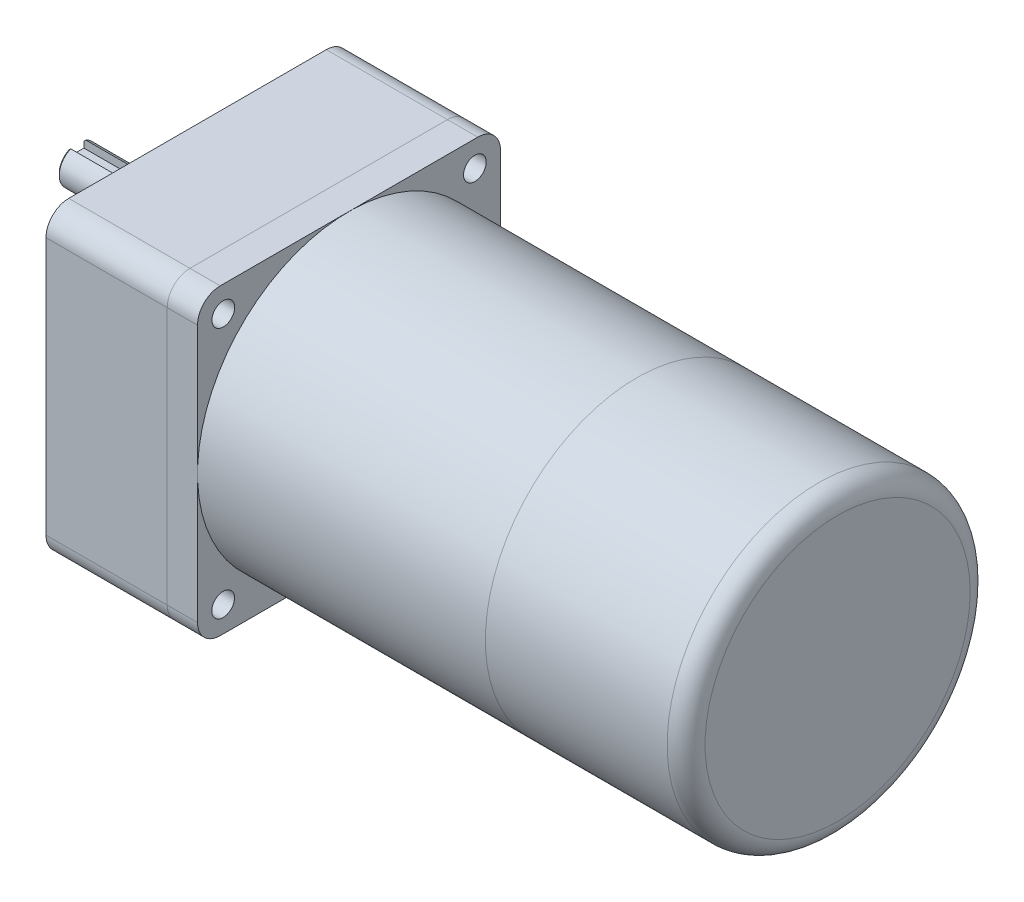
ISO-10303-21;
HEADER;
FILE_DESCRIPTION(('STEP AP214'),'2;1');
FILE_NAME('part.step','',(''),(''),'','','');
FILE_SCHEMA(('AUTOMOTIVE_DESIGN { 1 0 10303 214 1 1 1 1 }'));
ENDSEC;
DATA;
#1=APPLICATION_CONTEXT('core data for automotive mechanical design processes');
#2=APPLICATION_PROTOCOL_DEFINITION('international standard','automotive_design',2000,#1);
#3=PRODUCT_CONTEXT('',#1,'mechanical');
#4=PRODUCT('Part','Part','',(#3));
#5=PRODUCT_RELATED_PRODUCT_CATEGORY('part','',(#4));
#6=PRODUCT_DEFINITION_FORMATION('','',#4);
#7=PRODUCT_DEFINITION_CONTEXT('part definition',#1,'design');
#8=PRODUCT_DEFINITION('design','',#6,#7);
#9=PRODUCT_DEFINITION_SHAPE('','',#8);
#10=(LENGTH_UNIT() NAMED_UNIT(*) SI_UNIT(.MILLI.,.METRE.));
#11=(NAMED_UNIT(*) PLANE_ANGLE_UNIT() SI_UNIT($,.RADIAN.));
#12=(NAMED_UNIT(*) SI_UNIT($,.STERADIAN.) SOLID_ANGLE_UNIT());
#13=UNCERTAINTY_MEASURE_WITH_UNIT(LENGTH_MEASURE(1.E-05),#10,'distance_accuracy_value','');
#14=(GEOMETRIC_REPRESENTATION_CONTEXT(3) GLOBAL_UNCERTAINTY_ASSIGNED_CONTEXT((#13)) GLOBAL_UNIT_ASSIGNED_CONTEXT((#10,
#11,#12)) REPRESENTATION_CONTEXT('',''));
#15=CARTESIAN_POINT('',(0.,0.,0.));
#16=DIRECTION('',(0.,0.,1.));
#17=DIRECTION('',(1.,0.,0.));
#18=AXIS2_PLACEMENT_3D('',#15,#16,#17);
#19=CARTESIAN_POINT('',(-32.,15.,0.));
#20=DIRECTION('',(1.,0.,0.));
#21=DIRECTION('',(0.,0.,-1.));
#22=AXIS2_PLACEMENT_3D('',#19,#20,#21);
#23=CYLINDRICAL_SURFACE('',#22,5.);
#24=DIRECTION('',(1.,0.,0.));
#25=VECTOR('',#24,1.);
#26=CARTESIAN_POINT('',(-32.,19.5825756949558,2.));
#27=LINE('',#26,#25);
#28=CARTESIAN_POINT('',(-9.,19.5825756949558,2.));
#29=VERTEX_POINT('',#28);
#30=CARTESIAN_POINT('',(-31.5,19.5825756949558,2.));
#31=VERTEX_POINT('',#30);
#32=EDGE_CURVE('E133',#29,#31,#27,.F.);
#33=ORIENTED_EDGE('',*,*,#32,.T.);
#34=CARTESIAN_POINT('',(-31.5,15.,0.));
#35=DIRECTION('',(-1.,0.,0.));
#36=DIRECTION('',(0.,0.,1.));
#37=AXIS2_PLACEMENT_3D('',#34,#35,#36);
#38=CIRCLE('',#37,5.);
#39=CARTESIAN_POINT('',(-31.5,19.5825756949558,-2.));
#40=VERTEX_POINT('',#39);
#41=EDGE_CURVE('E61',#31,#40,#38,.F.);
#42=ORIENTED_EDGE('',*,*,#41,.T.);
#43=DIRECTION('',(1.,0.,0.));
#44=VECTOR('',#43,1.);
#45=CARTESIAN_POINT('',(-32.,19.5825756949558,-2.));
#46=LINE('',#45,#44);
#47=CARTESIAN_POINT('',(-9.,19.5825756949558,-2.));
#48=VERTEX_POINT('',#47);
#49=EDGE_CURVE('E128',#40,#48,#46,.T.);
#50=ORIENTED_EDGE('',*,*,#49,.T.);
#51=CARTESIAN_POINT('',(-9.,19.5825756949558,-2.));
#52=CARTESIAN_POINT('',(-8.94619414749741,19.5825646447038,-2.00000798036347));
#53=CARTESIAN_POINT('',(-8.89239433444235,19.5835230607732,-1.99782891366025));
#54=CARTESIAN_POINT('',(-8.7852287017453,19.5872962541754,-1.98915905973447));
#55=CARTESIAN_POINT('',(-8.73186272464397,19.5901103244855,-1.98266991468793));
#56=CARTESIAN_POINT('',(-8.62615317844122,19.5974978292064,-1.9654760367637));
#57=CARTESIAN_POINT('',(-8.57380641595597,19.6020643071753,-1.95478796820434));
#58=CARTESIAN_POINT('',(-8.47029922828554,19.6128005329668,-1.92931630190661));
#59=CARTESIAN_POINT('',(-8.41913887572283,19.618970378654,-1.91453245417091));
#60=CARTESIAN_POINT('',(-8.26806414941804,19.6395929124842,-1.86426971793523));
#61=CARTESIAN_POINT('',(-8.17034576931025,19.6561744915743,-1.82284489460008));
#62=CARTESIAN_POINT('',(-7.98320441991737,19.6931237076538,-1.72548191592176));
#63=CARTESIAN_POINT('',(-7.89378944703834,19.7134949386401,-1.66952996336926));
#64=CARTESIAN_POINT('',(-7.72073760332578,19.7570099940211,-1.54131835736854));
#65=CARTESIAN_POINT('',(-7.63763278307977,19.7802424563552,-1.4683691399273));
#66=CARTESIAN_POINT('',(-7.48445972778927,19.8261279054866,-1.30969646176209));
#67=CARTESIAN_POINT('',(-7.41439416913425,19.8487807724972,-1.22397038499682));
#68=CARTESIAN_POINT('',(-7.28659360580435,19.8920341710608,-1.03800590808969));
#69=CARTESIAN_POINT('',(-7.22945519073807,19.9125182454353,-0.937327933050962));
#70=CARTESIAN_POINT('',(-7.13315592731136,19.94803944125,-0.72682414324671));
#71=CARTESIAN_POINT('',(-7.09398757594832,19.9630788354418,-0.617002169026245));
#72=CARTESIAN_POINT('',(-7.03665879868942,19.9853831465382,-0.396967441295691));
#73=CARTESIAN_POINT('',(-7.01757304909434,19.9929892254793,-0.287031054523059));
#74=CARTESIAN_POINT('',(-6.99797152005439,20.0008031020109,-0.0652684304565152));
#75=CARTESIAN_POINT('',(-6.99744916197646,20.0010135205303,0.0465571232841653));
#76=CARTESIAN_POINT('',(-7.01448283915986,19.994219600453,0.262233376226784));
#77=CARTESIAN_POINT('',(-7.03102504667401,19.9876198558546,0.366179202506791));
#78=CARTESIAN_POINT('',(-7.07999342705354,19.9684927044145,0.569674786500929));
#79=CARTESIAN_POINT('',(-7.11242049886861,19.9559649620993,0.669224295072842));
#80=CARTESIAN_POINT('',(-7.19263629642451,19.9259683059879,0.862897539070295));
#81=CARTESIAN_POINT('',(-7.24064924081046,19.9084277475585,0.95691685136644));
#82=CARTESIAN_POINT('',(-7.35046458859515,19.8701460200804,1.13580746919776));
#83=CARTESIAN_POINT('',(-7.41227182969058,19.8494037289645,1.22067554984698));
#84=CARTESIAN_POINT('',(-7.55264418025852,19.8052178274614,1.38476339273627));
#85=CARTESIAN_POINT('',(-7.63204247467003,19.7816862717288,1.4632477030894));
#86=CARTESIAN_POINT('',(-7.80298009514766,19.7356195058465,1.60609926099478));
#87=CARTESIAN_POINT('',(-7.89452492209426,19.7130847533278,1.67046007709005));
#88=CARTESIAN_POINT('',(-8.09047028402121,19.6709568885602,1.78493657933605));
#89=CARTESIAN_POINT('',(-8.1951648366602,19.6514670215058,1.83458932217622));
#90=CARTESIAN_POINT('',(-8.41236152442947,19.6188610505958,1.91521298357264));
#91=CARTESIAN_POINT('',(-8.5248494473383,19.6057336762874,1.94621696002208));
#92=CARTESIAN_POINT('',(-8.69874363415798,19.5920830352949,1.9781058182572));
#93=CARTESIAN_POINT('',(-8.75865754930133,19.5885343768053,1.98630505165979));
#94=CARTESIAN_POINT('',(-8.87903501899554,19.5837754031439,1.99725282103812));
#95=CARTESIAN_POINT('',(-8.93949821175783,19.5825636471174,2.00000471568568));
#96=CARTESIAN_POINT('',(-9.,19.5825756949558,2.));
#97=B_SPLINE_CURVE_WITH_KNOTS('',3,(#51,#52,#53,#54,#55,#56,#57,#58,#59,#60,#61,#62,#63,#64,#65,
#66,#67,#68,#69,#70,#71,#72,#73,#74,#75,#76,#77,#78,#79,#80,#81,#82,#83,#84,#85,#86,#87,#88,#89,
#90,#91,#92,#93,#94,#95,#96),.UNSPECIFIED.,.F.,.F.,(4,2,2,2,2,2,2,2,2,2,2,2,2,2,2,2,2,2,2,2,2,2,
4),(0.,0.161354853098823,0.322648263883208,0.48330791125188,0.643977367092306,0.964683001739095,
1.28569434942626,1.62318047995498,1.96073580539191,2.31162858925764,2.66237473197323,
2.9961387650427,3.32978451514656,3.64468915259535,3.95961161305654,4.27928176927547,
4.59906421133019,4.93981874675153,5.28072813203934,5.63144241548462,5.98153315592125,
6.16300192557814,6.34435877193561),.UNSPECIFIED.);
#98=EDGE_CURVE('E107',#48,#29,#97,.T.);
#99=ORIENTED_EDGE('',*,*,#98,.T.);
#100=EDGE_LOOP('',(#33,#42,#50,#99));
#101=FACE_BOUND('',#100,.T.);
#102=CARTESIAN_POINT('',(-3.7,15.,0.));
#103=DIRECTION('',(-1.,0.,0.));
#104=DIRECTION('',(0.,0.,1.));
#105=AXIS2_PLACEMENT_3D('',#102,#103,#104);
#106=CIRCLE('',#105,5.);
#107=CARTESIAN_POINT('',(-3.7,15.,5.));
#108=VERTEX_POINT('',#107);
#109=EDGE_CURVE('E135',#108,#108,#106,.T.);
#110=ORIENTED_EDGE('',*,*,#109,.T.);
#111=EDGE_LOOP('',(#110));
#112=FACE_BOUND('',#111,.T.);
#113=ADVANCED_FACE('F48',(#101,#112),#23,.T.);
#114=CARTESIAN_POINT('',(-32.,15.,0.));
#115=DIRECTION('',(-1.,0.,0.));
#116=DIRECTION('',(0.,0.,1.));
#117=AXIS2_PLACEMENT_3D('',#114,#115,#116);
#118=PLANE('',#117);
#119=DIRECTION('',(0.,1.,0.));
#120=VECTOR('',#119,1.);
#121=CARTESIAN_POINT('',(-32.,17.5,-2.));
#122=LINE('',#121,#120);
#123=CARTESIAN_POINT('',(-32.,17.5,-2.));
#124=VERTEX_POINT('',#123);
#125=CARTESIAN_POINT('',(-32.,19.0311288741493,-2.));
#126=VERTEX_POINT('',#125);
#127=EDGE_CURVE('E109',#124,#126,#122,.T.);
#128=ORIENTED_EDGE('',*,*,#127,.T.);
#129=CARTESIAN_POINT('',(-32.,15.,0.));
#130=DIRECTION('',(-1.,0.,0.));
#131=DIRECTION('',(0.,0.,1.));
#132=AXIS2_PLACEMENT_3D('',#129,#130,#131);
#133=CIRCLE('',#132,4.50000000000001);
#134=CARTESIAN_POINT('',(-32.,19.0311288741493,2.));
#135=VERTEX_POINT('',#134);
#136=EDGE_CURVE('E143',#126,#135,#133,.T.);
#137=ORIENTED_EDGE('',*,*,#136,.T.);
#138=DIRECTION('',(0.,1.,0.));
#139=VECTOR('',#138,1.);
#140=CARTESIAN_POINT('',(-32.,17.5,2.));
#141=LINE('',#140,#139);
#142=CARTESIAN_POINT('',(-32.,17.5,2.));
#143=VERTEX_POINT('',#142);
#144=EDGE_CURVE('E129',#143,#135,#141,.T.);
#145=ORIENTED_EDGE('',*,*,#144,.F.);
#146=DIRECTION('',(0.,0.,1.));
#147=VECTOR('',#146,1.);
#148=CARTESIAN_POINT('',(-32.,17.5,-2.));
#149=LINE('',#148,#147);
#150=EDGE_CURVE('E118',#124,#143,#149,.T.);
#151=ORIENTED_EDGE('',*,*,#150,.F.);
#152=EDGE_LOOP('',(#128,#137,#145,#151));
#153=FACE_BOUND('',#152,.T.);
#154=ADVANCED_FACE('F154',(#153),#118,.T.);
#155=CARTESIAN_POINT('',(-3.7,15.,0.));
#156=DIRECTION('',(-1.,0.,0.));
#157=DIRECTION('',(0.,0.,1.));
#158=AXIS2_PLACEMENT_3D('',#155,#156,#157);
#159=PLANE('',#158);
#160=ORIENTED_EDGE('',*,*,#109,.F.);
#161=EDGE_LOOP('',(#160));
#162=FACE_BOUND('',#161,.T.);
#163=ADVANCED_FACE('F151',(#162),#159,.F.);
#164=CARTESIAN_POINT('',(-9.,17.5,0.));
#165=DIRECTION('',(0.,1.,0.));
#166=DIRECTION('',(0.,0.,1.));
#167=AXIS2_PLACEMENT_3D('',#164,#165,#166);
#168=CYLINDRICAL_SURFACE('',#167,2.);
#169=DIRECTION('',(0.,1.,0.));
#170=VECTOR('',#169,1.);
#171=CARTESIAN_POINT('',(-9.,17.5,-2.));
#172=LINE('',#171,#170);
#173=CARTESIAN_POINT('',(-9.,17.5,-2.));
#174=VERTEX_POINT('',#173);
#175=EDGE_CURVE('E99',#174,#48,#172,.T.);
#176=ORIENTED_EDGE('',*,*,#175,.F.);
#177=CARTESIAN_POINT('',(-9.,17.5,0.));
#178=DIRECTION('',(0.,1.,0.));
#179=DIRECTION('',(0.,0.,1.));
#180=AXIS2_PLACEMENT_3D('',#177,#178,#179);
#181=CIRCLE('',#180,2.);
#182=CARTESIAN_POINT('',(-9.,17.5,2.));
#183=VERTEX_POINT('',#182);
#184=EDGE_CURVE('E104',#183,#174,#181,.T.);
#185=ORIENTED_EDGE('',*,*,#184,.F.);
#186=DIRECTION('',(0.,1.,0.));
#187=VECTOR('',#186,1.);
#188=CARTESIAN_POINT('',(-9.,17.5,2.));
#189=LINE('',#188,#187);
#190=EDGE_CURVE('E126',#183,#29,#189,.T.);
#191=ORIENTED_EDGE('',*,*,#190,.T.);
#192=ORIENTED_EDGE('',*,*,#98,.F.);
#193=EDGE_LOOP('',(#176,#185,#191,#192));
#194=FACE_BOUND('',#193,.T.);
#195=ADVANCED_FACE('F101',(#194),#168,.F.);
#196=CARTESIAN_POINT('',(-32.,17.5,2.));
#197=DIRECTION('',(0.,0.,1.));
#198=DIRECTION('',(1.,0.,0.));
#199=AXIS2_PLACEMENT_3D('',#196,#197,#198);
#200=PLANE('',#199);
#201=ORIENTED_EDGE('',*,*,#144,.T.);
#202=CARTESIAN_POINT('',(-32.,19.0311288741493,2.));
#203=CARTESIAN_POINT('',(-31.9586097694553,19.0773327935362,2.));
#204=CARTESIAN_POINT('',(-31.9171421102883,19.1234672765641,2.));
#205=CARTESIAN_POINT('',(-31.8340649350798,19.2156076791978,2.));
#206=CARTESIAN_POINT('',(-31.7924554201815,19.2616135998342,2.));
#207=CARTESIAN_POINT('',(-31.7091069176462,19.3535078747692,2.));
#208=CARTESIAN_POINT('',(-31.6673679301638,19.3993962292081,2.));
#209=CARTESIAN_POINT('',(-31.5837706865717,19.4910648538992,2.));
#210=CARTESIAN_POINT('',(-31.5419124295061,19.5368451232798,2.));
#211=CARTESIAN_POINT('',(-31.5,19.5825756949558,2.));
#212=B_SPLINE_CURVE_WITH_KNOTS('',3,(#202,#203,#204,#205,#206,#207,#208,#209,#210,#211),
.UNSPECIFIED.,.F.,.F.,(4,2,2,2,4),(0.,0.186095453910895,0.372189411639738,0.558283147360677,
0.744378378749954),.UNSPECIFIED.);
#213=EDGE_CURVE('E75',#135,#31,#212,.T.);
#214=ORIENTED_EDGE('',*,*,#213,.T.);
#215=ORIENTED_EDGE('',*,*,#32,.F.);
#216=ORIENTED_EDGE('',*,*,#190,.F.);
#217=DIRECTION('',(1.,0.,0.));
#218=VECTOR('',#217,1.);
#219=CARTESIAN_POINT('',(-32.,17.5,2.));
#220=LINE('',#219,#218);
#221=EDGE_CURVE('E110',#143,#183,#220,.T.);
#222=ORIENTED_EDGE('',*,*,#221,.F.);
#223=EDGE_LOOP('',(#201,#214,#215,#216,#222));
#224=FACE_BOUND('',#223,.T.);
#225=ADVANCED_FACE('F150',(#224),#200,.F.);
#226=CARTESIAN_POINT('',(-9.,17.5,-2.));
#227=DIRECTION('',(0.,0.,-1.));
#228=DIRECTION('',(-1.,0.,0.));
#229=AXIS2_PLACEMENT_3D('',#226,#227,#228);
#230=PLANE('',#229);
#231=ORIENTED_EDGE('',*,*,#49,.F.);
#232=CARTESIAN_POINT('',(-31.5,19.5825756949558,-2.));
#233=CARTESIAN_POINT('',(-31.5419124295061,19.5368451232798,-2.));
#234=CARTESIAN_POINT('',(-31.5837706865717,19.4910648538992,-2.));
#235=CARTESIAN_POINT('',(-31.6673679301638,19.3993962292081,-2.));
#236=CARTESIAN_POINT('',(-31.7091069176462,19.3535078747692,-2.));
#237=CARTESIAN_POINT('',(-31.7924554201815,19.2616135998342,-2.));
#238=CARTESIAN_POINT('',(-31.8340649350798,19.2156076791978,-2.));
#239=CARTESIAN_POINT('',(-31.9171421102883,19.1234672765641,-2.));
#240=CARTESIAN_POINT('',(-31.9586097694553,19.0773327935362,-2.));
#241=CARTESIAN_POINT('',(-32.,19.0311288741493,-2.));
#242=B_SPLINE_CURVE_WITH_KNOTS('',3,(#232,#233,#234,#235,#236,#237,#238,#239,#240,#241),
.UNSPECIFIED.,.F.,.F.,(4,2,2,2,4),(0.,0.186095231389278,0.372188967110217,0.558282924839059,
0.744378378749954),.UNSPECIFIED.);
#243=EDGE_CURVE('E12',#40,#126,#242,.T.);
#244=ORIENTED_EDGE('',*,*,#243,.T.);
#245=ORIENTED_EDGE('',*,*,#127,.F.);
#246=DIRECTION('',(-1.,0.,0.));
#247=VECTOR('',#246,1.);
#248=CARTESIAN_POINT('',(-9.,17.5,-2.));
#249=LINE('',#248,#247);
#250=EDGE_CURVE('E113',#174,#124,#249,.T.);
#251=ORIENTED_EDGE('',*,*,#250,.F.);
#252=ORIENTED_EDGE('',*,*,#175,.T.);
#253=EDGE_LOOP('',(#231,#244,#245,#251,#252));
#254=FACE_BOUND('',#253,.T.);
#255=ADVANCED_FACE('F114',(#254),#230,.F.);
#256=CARTESIAN_POINT('',(-9.,17.5,0.));
#257=DIRECTION('',(0.,1.,0.));
#258=DIRECTION('',(0.,0.,1.));
#259=AXIS2_PLACEMENT_3D('',#256,#257,#258);
#260=PLANE('',#259);
#261=ORIENTED_EDGE('',*,*,#184,.T.);
#262=ORIENTED_EDGE('',*,*,#250,.T.);
#263=ORIENTED_EDGE('',*,*,#150,.T.);
#264=ORIENTED_EDGE('',*,*,#221,.T.);
#265=EDGE_LOOP('',(#261,#262,#263,#264));
#266=FACE_BOUND('',#265,.T.);
#267=ADVANCED_FACE('F120',(#266),#260,.T.);
#268=CARTESIAN_POINT('',(-32.,15.,0.));
#269=DIRECTION('',(1.,0.,0.));
#270=DIRECTION('',(0.,0.,-1.));
#271=AXIS2_PLACEMENT_3D('',#268,#269,#270);
#272=CONICAL_SURFACE('',#271,4.50000000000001,0.785398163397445);
#273=ORIENTED_EDGE('',*,*,#243,.F.);
#274=ORIENTED_EDGE('',*,*,#41,.F.);
#275=ORIENTED_EDGE('',*,*,#213,.F.);
#276=ORIENTED_EDGE('',*,*,#136,.F.);
#277=EDGE_LOOP('',(#273,#274,#275,#276));
#278=FACE_BOUND('',#277,.T.);
#279=ADVANCED_FACE('F50',(#278),#272,.T.);
#280=CLOSED_SHELL('',(#113,#154,#163,#195,#225,#255,#267,#279));
#281=MANIFOLD_SOLID_BREP('B2',#280);
#282=CARTESIAN_POINT('',(-3.7,15.,0.));
#283=DIRECTION('',(1.,0.,0.));
#284=DIRECTION('',(0.,0.,-1.));
#285=AXIS2_PLACEMENT_3D('',#282,#283,#284);
#286=CYLINDRICAL_SURFACE('',#285,15.);
#287=CARTESIAN_POINT('',(-3.2,15.,0.));
#288=DIRECTION('',(-1.,0.,0.));
#289=DIRECTION('',(0.,0.,1.));
#290=AXIS2_PLACEMENT_3D('',#287,#288,#289);
#291=CIRCLE('',#290,15.);
#292=CARTESIAN_POINT('',(-3.2,15.,15.));
#293=VERTEX_POINT('',#292);
#294=EDGE_CURVE('E47',#293,#293,#291,.F.);
#295=ORIENTED_EDGE('',*,*,#294,.T.);
#296=EDGE_LOOP('',(#295));
#297=FACE_BOUND('',#296,.T.);
#298=CARTESIAN_POINT('',(0.,15.,0.));
#299=DIRECTION('',(-1.,0.,0.));
#300=DIRECTION('',(0.,0.,1.));
#301=AXIS2_PLACEMENT_3D('',#298,#299,#300);
#302=CIRCLE('',#301,15.);
#303=CARTESIAN_POINT('',(0.,15.,15.));
#304=VERTEX_POINT('',#303);
#305=EDGE_CURVE('E247',#304,#304,#302,.T.);
#306=ORIENTED_EDGE('',*,*,#305,.T.);
#307=EDGE_LOOP('',(#306));
#308=FACE_BOUND('',#307,.T.);
#309=ADVANCED_FACE('F236',(#297,#308),#286,.T.);
#310=CARTESIAN_POINT('',(-3.7,15.,0.));
#311=DIRECTION('',(-1.,0.,0.));
#312=DIRECTION('',(0.,0.,1.));
#313=AXIS2_PLACEMENT_3D('',#310,#311,#312);
#314=PLANE('',#313);
#315=CARTESIAN_POINT('',(-3.7,15.,0.));
#316=DIRECTION('',(-1.,0.,0.));
#317=DIRECTION('',(0.,0.,1.));
#318=AXIS2_PLACEMENT_3D('',#315,#316,#317);
#319=CIRCLE('',#318,14.5);
#320=CARTESIAN_POINT('',(-3.7,15.,14.5));
#321=VERTEX_POINT('',#320);
#322=EDGE_CURVE('E243',#321,#321,#319,.T.);
#323=ORIENTED_EDGE('',*,*,#322,.T.);
#324=EDGE_LOOP('',(#323));
#325=FACE_BOUND('',#324,.T.);
#326=ADVANCED_FACE('F257',(#325),#314,.T.);
#327=CARTESIAN_POINT('',(0.,15.,0.));
#328=DIRECTION('',(-1.,0.,0.));
#329=DIRECTION('',(0.,0.,1.));
#330=AXIS2_PLACEMENT_3D('',#327,#328,#329);
#331=PLANE('',#330);
#332=ORIENTED_EDGE('',*,*,#305,.F.);
#333=EDGE_LOOP('',(#332));
#334=FACE_BOUND('',#333,.T.);
#335=ADVANCED_FACE('F255',(#334),#331,.F.);
#336=CARTESIAN_POINT('',(-3.2,15.,0.));
#337=DIRECTION('',(-1.,0.,0.));
#338=DIRECTION('',(0.,0.,1.));
#339=AXIS2_PLACEMENT_3D('',#336,#337,#338);
#340=TOROIDAL_SURFACE('',#339,14.5,0.5);
#341=ORIENTED_EDGE('',*,*,#294,.F.);
#342=EDGE_LOOP('',(#341));
#343=FACE_BOUND('',#342,.T.);
#344=ORIENTED_EDGE('',*,*,#322,.F.);
#345=EDGE_LOOP('',(#344));
#346=FACE_BOUND('',#345,.T.);
#347=ADVANCED_FACE('F238',(#343,#346),#340,.T.);
#348=CLOSED_SHELL('',(#309,#326,#335,#347));
#349=MANIFOLD_SOLID_BREP('B6',#348);
#350=CARTESIAN_POINT('',(169.,0.,0.));
#351=DIRECTION('',(-1.,0.,0.));
#352=DIRECTION('',(0.,0.,1.));
#353=AXIS2_PLACEMENT_3D('',#350,#351,#352);
#354=CYLINDRICAL_SURFACE('',#353,40.);
#355=CARTESIAN_POINT('',(164.,0.,0.));
#356=DIRECTION('',(1.,0.,0.));
#357=DIRECTION('',(0.,0.,-1.));
#358=AXIS2_PLACEMENT_3D('',#355,#356,#357);
#359=CIRCLE('',#358,40.);
#360=CARTESIAN_POINT('',(164.,0.,-40.));
#361=VERTEX_POINT('',#360);
#362=EDGE_CURVE('E235',#361,#361,#359,.F.);
#363=ORIENTED_EDGE('',*,*,#362,.T.);
#364=EDGE_LOOP('',(#363));
#365=FACE_BOUND('',#364,.T.);
#366=CARTESIAN_POINT('',(116.,0.,0.));
#367=DIRECTION('',(1.,0.,0.));
#368=DIRECTION('',(0.,0.,-1.));
#369=AXIS2_PLACEMENT_3D('',#366,#367,#368);
#370=CIRCLE('',#369,40.);
#371=CARTESIAN_POINT('',(116.,0.,-40.));
#372=VERTEX_POINT('',#371);
#373=EDGE_CURVE('E311',#372,#372,#370,.T.);
#374=ORIENTED_EDGE('',*,*,#373,.T.);
#375=EDGE_LOOP('',(#374));
#376=FACE_BOUND('',#375,.T.);
#377=ADVANCED_FACE('F300',(#365,#376),#354,.T.);
#378=CARTESIAN_POINT('',(169.,0.,0.));
#379=DIRECTION('',(1.,0.,0.));
#380=DIRECTION('',(0.,0.,-1.));
#381=AXIS2_PLACEMENT_3D('',#378,#379,#380);
#382=PLANE('',#381);
#383=CARTESIAN_POINT('',(169.,0.,0.));
#384=DIRECTION('',(1.,0.,0.));
#385=DIRECTION('',(0.,0.,-1.));
#386=AXIS2_PLACEMENT_3D('',#383,#384,#385);
#387=CIRCLE('',#386,35.);
#388=CARTESIAN_POINT('',(169.,0.,-35.));
#389=VERTEX_POINT('',#388);
#390=EDGE_CURVE('E307',#389,#389,#387,.T.);
#391=ORIENTED_EDGE('',*,*,#390,.T.);
#392=EDGE_LOOP('',(#391));
#393=FACE_BOUND('',#392,.T.);
#394=ADVANCED_FACE('F321',(#393),#382,.T.);
#395=CARTESIAN_POINT('',(116.,0.,0.));
#396=DIRECTION('',(1.,0.,0.));
#397=DIRECTION('',(0.,0.,-1.));
#398=AXIS2_PLACEMENT_3D('',#395,#396,#397);
#399=PLANE('',#398);
#400=ORIENTED_EDGE('',*,*,#373,.F.);
#401=EDGE_LOOP('',(#400));
#402=FACE_BOUND('',#401,.T.);
#403=ADVANCED_FACE('F319',(#402),#399,.F.);
#404=CARTESIAN_POINT('',(164.,0.,0.));
#405=DIRECTION('',(1.,0.,0.));
#406=DIRECTION('',(0.,0.,-1.));
#407=AXIS2_PLACEMENT_3D('',#404,#405,#406);
#408=TOROIDAL_SURFACE('',#407,35.,5.);
#409=ORIENTED_EDGE('',*,*,#362,.F.);
#410=EDGE_LOOP('',(#409));
#411=FACE_BOUND('',#410,.T.);
#412=ORIENTED_EDGE('',*,*,#390,.F.);
#413=EDGE_LOOP('',(#412));
#414=FACE_BOUND('',#413,.T.);
#415=ADVANCED_FACE('F302',(#411,#414),#408,.T.);
#416=CLOSED_SHELL('',(#377,#394,#403,#415));
#417=MANIFOLD_SOLID_BREP('B42',#416);
#418=CARTESIAN_POINT('',(116.,0.,0.));
#419=DIRECTION('',(-1.,0.,0.));
#420=DIRECTION('',(0.,0.,1.));
#421=AXIS2_PLACEMENT_3D('',#418,#419,#420);
#422=CYLINDRICAL_SURFACE('',#421,40.);
#423=CARTESIAN_POINT('',(116.,0.,0.));
#424=DIRECTION('',(1.,0.,0.));
#425=DIRECTION('',(0.,0.,-1.));
#426=AXIS2_PLACEMENT_3D('',#423,#424,#425);
#427=CIRCLE('',#426,40.);
#428=CARTESIAN_POINT('',(116.,0.,-40.));
#429=VERTEX_POINT('',#428);
#430=EDGE_CURVE('E299',#429,#429,#427,.T.);
#431=ORIENTED_EDGE('',*,*,#430,.F.);
#432=EDGE_LOOP('',(#431));
#433=FACE_BOUND('',#432,.T.);
#434=CARTESIAN_POINT('',(40.,0.,0.));
#435=DIRECTION('',(1.,0.,0.));
#436=DIRECTION('',(0.,0.,-1.));
#437=AXIS2_PLACEMENT_3D('',#434,#435,#436);
#438=CIRCLE('',#437,40.);
#439=CARTESIAN_POINT('',(40.,0.,-40.));
#440=VERTEX_POINT('',#439);
#441=EDGE_CURVE('E369',#440,#440,#438,.T.);
#442=ORIENTED_EDGE('',*,*,#441,.T.);
#443=EDGE_LOOP('',(#442));
#444=FACE_BOUND('',#443,.T.);
#445=ADVANCED_FACE('F366',(#433,#444),#422,.T.);
#446=CARTESIAN_POINT('',(116.,0.,0.));
#447=DIRECTION('',(1.,0.,0.));
#448=DIRECTION('',(0.,0.,-1.));
#449=AXIS2_PLACEMENT_3D('',#446,#447,#448);
#450=PLANE('',#449);
#451=ORIENTED_EDGE('',*,*,#430,.T.);
#452=EDGE_LOOP('',(#451));
#453=FACE_BOUND('',#452,.T.);
#454=ADVANCED_FACE('F381',(#453),#450,.T.);
#455=CARTESIAN_POINT('',(40.,0.,0.));
#456=DIRECTION('',(1.,0.,0.));
#457=DIRECTION('',(0.,0.,-1.));
#458=AXIS2_PLACEMENT_3D('',#455,#456,#457);
#459=PLANE('',#458);
#460=ORIENTED_EDGE('',*,*,#441,.F.);
#461=EDGE_LOOP('',(#460));
#462=FACE_BOUND('',#461,.T.);
#463=ADVANCED_FACE('F379',(#462),#459,.F.);
#464=CLOSED_SHELL('',(#445,#454,#463));
#465=MANIFOLD_SOLID_BREP('B230',#464);
#466=CARTESIAN_POINT('',(40.,-34.,34.));
#467=DIRECTION('',(-1.,0.,0.));
#468=DIRECTION('',(0.,0.,1.));
#469=AXIS2_PLACEMENT_3D('',#466,#467,#468);
#470=CYLINDRICAL_SURFACE('',#469,6.);
#471=CARTESIAN_POINT('',(32.,-34.,34.));
#472=DIRECTION('',(1.,0.,0.));
#473=DIRECTION('',(0.,0.,1.));
#474=AXIS2_PLACEMENT_3D('',#471,#472,#473);
#475=CIRCLE('',#474,6.);
#476=CARTESIAN_POINT('',(32.,-34.,40.));
#477=VERTEX_POINT('',#476);
#478=CARTESIAN_POINT('',(32.,-40.,34.));
#479=VERTEX_POINT('',#478);
#480=EDGE_CURVE('E514',#477,#479,#475,.T.);
#481=ORIENTED_EDGE('',*,*,#480,.T.);
#482=DIRECTION('',(-1.,0.,0.));
#483=VECTOR('',#482,1.);
#484=CARTESIAN_POINT('',(40.,-40.,34.));
#485=LINE('',#484,#483);
#486=CARTESIAN_POINT('',(40.,-40.,34.));
#487=VERTEX_POINT('',#486);
#488=EDGE_CURVE('E364',#487,#479,#485,.T.);
#489=ORIENTED_EDGE('',*,*,#488,.F.);
#490=CARTESIAN_POINT('',(40.,-34.,34.));
#491=DIRECTION('',(1.,0.,0.));
#492=DIRECTION('',(0.,0.,1.));
#493=AXIS2_PLACEMENT_3D('',#490,#491,#492);
#494=CIRCLE('',#493,6.);
#495=CARTESIAN_POINT('',(40.,-34.,40.));
#496=VERTEX_POINT('',#495);
#497=EDGE_CURVE('E528',#496,#487,#494,.T.);
#498=ORIENTED_EDGE('',*,*,#497,.F.);
#499=DIRECTION('',(-1.,0.,0.));
#500=VECTOR('',#499,1.);
#501=CARTESIAN_POINT('',(40.,-34.,40.));
#502=LINE('',#501,#500);
#503=EDGE_CURVE('E510',#496,#477,#502,.T.);
#504=ORIENTED_EDGE('',*,*,#503,.T.);
#505=EDGE_LOOP('',(#481,#489,#498,#504));
#506=FACE_BOUND('',#505,.T.);
#507=ADVANCED_FACE('F416',(#506),#470,.T.);
#508=CARTESIAN_POINT('',(40.,-40.,34.));
#509=DIRECTION('',(0.,1.,0.));
#510=DIRECTION('',(0.,0.,1.));
#511=AXIS2_PLACEMENT_3D('',#508,#509,#510);
#512=PLANE('',#511);
#513=DIRECTION('',(0.,0.,-1.));
#514=VECTOR('',#513,1.);
#515=CARTESIAN_POINT('',(32.,-40.,34.));
#516=LINE('',#515,#514);
#517=CARTESIAN_POINT('',(32.,-40.,-34.));
#518=VERTEX_POINT('',#517);
#519=EDGE_CURVE('E517',#479,#518,#516,.T.);
#520=ORIENTED_EDGE('',*,*,#519,.T.);
#521=DIRECTION('',(-1.,0.,0.));
#522=VECTOR('',#521,1.);
#523=CARTESIAN_POINT('',(40.,-40.,-34.));
#524=LINE('',#523,#522);
#525=CARTESIAN_POINT('',(40.,-40.,-34.));
#526=VERTEX_POINT('',#525);
#527=EDGE_CURVE('E425',#526,#518,#524,.T.);
#528=ORIENTED_EDGE('',*,*,#527,.F.);
#529=DIRECTION('',(0.,0.,-1.));
#530=VECTOR('',#529,1.);
#531=CARTESIAN_POINT('',(40.,-40.,34.));
#532=LINE('',#531,#530);
#533=EDGE_CURVE('E477',#487,#526,#532,.T.);
#534=ORIENTED_EDGE('',*,*,#533,.F.);
#535=ORIENTED_EDGE('',*,*,#488,.T.);
#536=EDGE_LOOP('',(#520,#528,#534,#535));
#537=FACE_BOUND('',#536,.T.);
#538=ADVANCED_FACE('F582',(#537),#512,.F.);
#539=CARTESIAN_POINT('',(40.,-34.,-34.));
#540=DIRECTION('',(-1.,0.,0.));
#541=DIRECTION('',(0.,0.,1.));
#542=AXIS2_PLACEMENT_3D('',#539,#540,#541);
#543=CYLINDRICAL_SURFACE('',#542,6.);
#544=CARTESIAN_POINT('',(32.,-34.,-34.));
#545=DIRECTION('',(1.,0.,0.));
#546=DIRECTION('',(0.,0.,-1.));
#547=AXIS2_PLACEMENT_3D('',#544,#545,#546);
#548=CIRCLE('',#547,6.);
#549=CARTESIAN_POINT('',(32.,-34.,-40.));
#550=VERTEX_POINT('',#549);
#551=EDGE_CURVE('E519',#518,#550,#548,.T.);
#552=ORIENTED_EDGE('',*,*,#551,.T.);
#553=DIRECTION('',(-1.,0.,0.));
#554=VECTOR('',#553,1.);
#555=CARTESIAN_POINT('',(40.,-34.,-40.));
#556=LINE('',#555,#554);
#557=CARTESIAN_POINT('',(40.,-34.,-40.));
#558=VERTEX_POINT('',#557);
#559=EDGE_CURVE('E535',#558,#550,#556,.T.);
#560=ORIENTED_EDGE('',*,*,#559,.F.);
#561=CARTESIAN_POINT('',(40.,-34.,-34.));
#562=DIRECTION('',(1.,0.,0.));
#563=DIRECTION('',(0.,0.,-1.));
#564=AXIS2_PLACEMENT_3D('',#561,#562,#563);
#565=CIRCLE('',#564,6.);
#566=EDGE_CURVE('E683',#526,#558,#565,.T.);
#567=ORIENTED_EDGE('',*,*,#566,.F.);
#568=ORIENTED_EDGE('',*,*,#527,.T.);
#569=EDGE_LOOP('',(#552,#560,#567,#568));
#570=FACE_BOUND('',#569,.T.);
#571=ADVANCED_FACE('F586',(#570),#543,.T.);
#572=CARTESIAN_POINT('',(40.,-34.,-40.));
#573=DIRECTION('',(0.,0.,1.));
#574=DIRECTION('',(1.,0.,0.));
#575=AXIS2_PLACEMENT_3D('',#572,#573,#574);
#576=PLANE('',#575);
#577=DIRECTION('',(0.,1.,0.));
#578=VECTOR('',#577,1.);
#579=CARTESIAN_POINT('',(32.,-34.,-40.));
#580=LINE('',#579,#578);
#581=CARTESIAN_POINT('',(32.,34.,-40.));
#582=VERTEX_POINT('',#581);
#583=EDGE_CURVE('E521',#550,#582,#580,.T.);
#584=ORIENTED_EDGE('',*,*,#583,.T.);
#585=DIRECTION('',(-1.,0.,0.));
#586=VECTOR('',#585,1.);
#587=CARTESIAN_POINT('',(40.,34.,-40.));
#588=LINE('',#587,#586);
#589=CARTESIAN_POINT('',(40.,34.,-40.));
#590=VERTEX_POINT('',#589);
#591=EDGE_CURVE('E532',#590,#582,#588,.T.);
#592=ORIENTED_EDGE('',*,*,#591,.F.);
#593=DIRECTION('',(0.,1.,0.));
#594=VECTOR('',#593,1.);
#595=CARTESIAN_POINT('',(40.,-34.,-40.));
#596=LINE('',#595,#594);
#597=EDGE_CURVE('E685',#558,#590,#596,.T.);
#598=ORIENTED_EDGE('',*,*,#597,.F.);
#599=ORIENTED_EDGE('',*,*,#559,.T.);
#600=EDGE_LOOP('',(#584,#592,#598,#599));
#601=FACE_BOUND('',#600,.T.);
#602=ADVANCED_FACE('F590',(#601),#576,.F.);
#603=CARTESIAN_POINT('',(40.,34.,-34.));
#604=DIRECTION('',(-1.,0.,0.));
#605=DIRECTION('',(0.,0.,1.));
#606=AXIS2_PLACEMENT_3D('',#603,#604,#605);
#607=CYLINDRICAL_SURFACE('',#606,6.);
#608=CARTESIAN_POINT('',(32.,34.,-34.));
#609=DIRECTION('',(1.,0.,0.));
#610=DIRECTION('',(0.,0.,1.));
#611=AXIS2_PLACEMENT_3D('',#608,#609,#610);
#612=CIRCLE('',#611,6.);
#613=CARTESIAN_POINT('',(32.,40.,-34.));
#614=VERTEX_POINT('',#613);
#615=EDGE_CURVE('E523',#582,#614,#612,.T.);
#616=ORIENTED_EDGE('',*,*,#615,.T.);
#617=DIRECTION('',(-1.,0.,0.));
#618=VECTOR('',#617,1.);
#619=CARTESIAN_POINT('',(40.,40.,-34.));
#620=LINE('',#619,#618);
#621=CARTESIAN_POINT('',(40.,40.,-34.));
#622=VERTEX_POINT('',#621);
#623=EDGE_CURVE('E505',#622,#614,#620,.T.);
#624=ORIENTED_EDGE('',*,*,#623,.F.);
#625=CARTESIAN_POINT('',(40.,34.,-34.));
#626=DIRECTION('',(1.,0.,0.));
#627=DIRECTION('',(0.,0.,1.));
#628=AXIS2_PLACEMENT_3D('',#625,#626,#627);
#629=CIRCLE('',#628,6.);
#630=EDGE_CURVE('E496',#590,#622,#629,.T.);
#631=ORIENTED_EDGE('',*,*,#630,.F.);
#632=ORIENTED_EDGE('',*,*,#591,.T.);
#633=EDGE_LOOP('',(#616,#624,#631,#632));
#634=FACE_BOUND('',#633,.T.);
#635=ADVANCED_FACE('F596',(#634),#607,.T.);
#636=CARTESIAN_POINT('',(40.,40.,34.));
#637=DIRECTION('',(0.,-1.,0.));
#638=DIRECTION('',(0.,0.,-1.));
#639=AXIS2_PLACEMENT_3D('',#636,#637,#638);
#640=PLANE('',#639);
#641=DIRECTION('',(0.,0.,1.));
#642=VECTOR('',#641,1.);
#643=CARTESIAN_POINT('',(32.,40.,34.));
#644=LINE('',#643,#642);
#645=CARTESIAN_POINT('',(32.,40.,34.));
#646=VERTEX_POINT('',#645);
#647=EDGE_CURVE('E504',#614,#646,#644,.T.);
#648=ORIENTED_EDGE('',*,*,#647,.T.);
#649=DIRECTION('',(-1.,0.,0.));
#650=VECTOR('',#649,1.);
#651=CARTESIAN_POINT('',(40.,40.,34.));
#652=LINE('',#651,#650);
#653=CARTESIAN_POINT('',(40.,40.,34.));
#654=VERTEX_POINT('',#653);
#655=EDGE_CURVE('E501',#654,#646,#652,.T.);
#656=ORIENTED_EDGE('',*,*,#655,.F.);
#657=DIRECTION('',(0.,0.,1.));
#658=VECTOR('',#657,1.);
#659=CARTESIAN_POINT('',(40.,40.,34.));
#660=LINE('',#659,#658);
#661=EDGE_CURVE('E490',#622,#654,#660,.T.);
#662=ORIENTED_EDGE('',*,*,#661,.F.);
#663=ORIENTED_EDGE('',*,*,#623,.T.);
#664=EDGE_LOOP('',(#648,#656,#662,#663));
#665=FACE_BOUND('',#664,.T.);
#666=ADVANCED_FACE('F502',(#665),#640,.F.);
#667=CARTESIAN_POINT('',(40.,34.,34.));
#668=DIRECTION('',(-1.,0.,0.));
#669=DIRECTION('',(0.,0.,1.));
#670=AXIS2_PLACEMENT_3D('',#667,#668,#669);
#671=CYLINDRICAL_SURFACE('',#670,6.);
#672=CARTESIAN_POINT('',(32.,34.,34.));
#673=DIRECTION('',(1.,0.,0.));
#674=DIRECTION('',(0.,0.,1.));
#675=AXIS2_PLACEMENT_3D('',#672,#673,#674);
#676=CIRCLE('',#675,6.);
#677=CARTESIAN_POINT('',(32.,34.,40.));
#678=VERTEX_POINT('',#677);
#679=EDGE_CURVE('E463',#646,#678,#676,.T.);
#680=ORIENTED_EDGE('',*,*,#679,.T.);
#681=DIRECTION('',(-1.,0.,0.));
#682=VECTOR('',#681,1.);
#683=CARTESIAN_POINT('',(40.,34.,40.));
#684=LINE('',#683,#682);
#685=CARTESIAN_POINT('',(40.,34.,40.));
#686=VERTEX_POINT('',#685);
#687=EDGE_CURVE('E506',#686,#678,#684,.T.);
#688=ORIENTED_EDGE('',*,*,#687,.F.);
#689=CARTESIAN_POINT('',(40.,34.,34.));
#690=DIRECTION('',(1.,0.,0.));
#691=DIRECTION('',(0.,0.,1.));
#692=AXIS2_PLACEMENT_3D('',#689,#690,#691);
#693=CIRCLE('',#692,6.);
#694=EDGE_CURVE('E494',#654,#686,#693,.T.);
#695=ORIENTED_EDGE('',*,*,#694,.F.);
#696=ORIENTED_EDGE('',*,*,#655,.T.);
#697=EDGE_LOOP('',(#680,#688,#695,#696));
#698=FACE_BOUND('',#697,.T.);
#699=ADVANCED_FACE('F508',(#698),#671,.T.);
#700=CARTESIAN_POINT('',(40.,-34.,40.));
#701=DIRECTION('',(0.,0.,-1.));
#702=DIRECTION('',(-1.,0.,0.));
#703=AXIS2_PLACEMENT_3D('',#700,#701,#702);
#704=PLANE('',#703);
#705=DIRECTION('',(0.,-1.,0.));
#706=VECTOR('',#705,1.);
#707=CARTESIAN_POINT('',(32.,-34.,40.));
#708=LINE('',#707,#706);
#709=EDGE_CURVE('E469',#678,#477,#708,.T.);
#710=ORIENTED_EDGE('',*,*,#709,.T.);
#711=ORIENTED_EDGE('',*,*,#503,.F.);
#712=DIRECTION('',(0.,-1.,0.));
#713=VECTOR('',#712,1.);
#714=CARTESIAN_POINT('',(40.,-34.,40.));
#715=LINE('',#714,#713);
#716=EDGE_CURVE('E434',#686,#496,#715,.T.);
#717=ORIENTED_EDGE('',*,*,#716,.F.);
#718=ORIENTED_EDGE('',*,*,#687,.T.);
#719=EDGE_LOOP('',(#710,#711,#717,#718));
#720=FACE_BOUND('',#719,.T.);
#721=ADVANCED_FACE('F571',(#720),#704,.F.);
#722=CARTESIAN_POINT('',(40.,-34.,34.));
#723=DIRECTION('',(-1.,0.,0.));
#724=DIRECTION('',(0.,0.,1.));
#725=AXIS2_PLACEMENT_3D('',#722,#723,#724);
#726=PLANE('',#725);
#727=CARTESIAN_POINT('',(40.,33.1906810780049,33.1906810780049));
#728=DIRECTION('',(1.,0.,0.));
#729=DIRECTION('',(0.,0.,-1.));
#730=AXIS2_PLACEMENT_3D('',#727,#728,#729);
#731=CIRCLE('',#730,3.);
#732=CARTESIAN_POINT('',(40.,33.1906810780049,30.1906810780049));
#733=VERTEX_POINT('',#732);
#734=EDGE_CURVE('E544',#733,#733,#731,.T.);
#735=ORIENTED_EDGE('',*,*,#734,.F.);
#736=EDGE_LOOP('',(#735));
#737=FACE_BOUND('',#736,.T.);
#738=CARTESIAN_POINT('',(40.,33.2340187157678,-33.2340187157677));
#739=DIRECTION('',(1.,0.,0.));
#740=DIRECTION('',(0.,0.,-1.));
#741=AXIS2_PLACEMENT_3D('',#738,#739,#740);
#742=CIRCLE('',#741,3.);
#743=CARTESIAN_POINT('',(40.,33.2340187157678,-36.2340187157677));
#744=VERTEX_POINT('',#743);
#745=EDGE_CURVE('E669',#744,#744,#742,.T.);
#746=ORIENTED_EDGE('',*,*,#745,.F.);
#747=EDGE_LOOP('',(#746));
#748=FACE_BOUND('',#747,.T.);
#749=CARTESIAN_POINT('',(40.,-33.2340187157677,-33.2340187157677));
#750=DIRECTION('',(1.,0.,0.));
#751=DIRECTION('',(0.,0.,-1.));
#752=AXIS2_PLACEMENT_3D('',#749,#750,#751);
#753=CIRCLE('',#752,3.);
#754=CARTESIAN_POINT('',(40.,-33.2340187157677,-36.2340187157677));
#755=VERTEX_POINT('',#754);
#756=EDGE_CURVE('E671',#755,#755,#753,.T.);
#757=ORIENTED_EDGE('',*,*,#756,.F.);
#758=EDGE_LOOP('',(#757));
#759=FACE_BOUND('',#758,.T.);
#760=CARTESIAN_POINT('',(40.,-33.2340187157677,33.2340187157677));
#761=DIRECTION('',(1.,0.,0.));
#762=DIRECTION('',(0.,0.,-1.));
#763=AXIS2_PLACEMENT_3D('',#760,#761,#762);
#764=CIRCLE('',#763,3.);
#765=CARTESIAN_POINT('',(40.,-33.2340187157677,30.2340187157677));
#766=VERTEX_POINT('',#765);
#767=EDGE_CURVE('E676',#766,#766,#764,.T.);
#768=ORIENTED_EDGE('',*,*,#767,.F.);
#769=EDGE_LOOP('',(#768));
#770=FACE_BOUND('',#769,.T.);
#771=ORIENTED_EDGE('',*,*,#497,.T.);
#772=ORIENTED_EDGE('',*,*,#533,.T.);
#773=ORIENTED_EDGE('',*,*,#566,.T.);
#774=ORIENTED_EDGE('',*,*,#597,.T.);
#775=ORIENTED_EDGE('',*,*,#630,.T.);
#776=ORIENTED_EDGE('',*,*,#661,.T.);
#777=ORIENTED_EDGE('',*,*,#694,.T.);
#778=ORIENTED_EDGE('',*,*,#716,.T.);
#779=EDGE_LOOP('',(#771,#772,#773,#774,#775,#776,#777,#778));
#780=FACE_BOUND('',#779,.T.);
#781=ADVANCED_FACE('F492',(#737,#748,#759,#770,#780),#726,.F.);
#782=CARTESIAN_POINT('',(32.,-34.,34.));
#783=DIRECTION('',(-1.,0.,0.));
#784=DIRECTION('',(0.,0.,1.));
#785=AXIS2_PLACEMENT_3D('',#782,#783,#784);
#786=PLANE('',#785);
#787=CARTESIAN_POINT('',(32.,33.1906810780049,33.1906810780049));
#788=DIRECTION('',(-1.,0.,0.));
#789=DIRECTION('',(0.,0.,1.));
#790=AXIS2_PLACEMENT_3D('',#787,#788,#789);
#791=CIRCLE('',#790,3.);
#792=CARTESIAN_POINT('',(32.,33.1906810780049,30.1906810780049));
#793=VERTEX_POINT('',#792);
#794=EDGE_CURVE('E419',#793,#793,#791,.T.);
#795=ORIENTED_EDGE('',*,*,#794,.F.);
#796=EDGE_LOOP('',(#795));
#797=FACE_BOUND('',#796,.T.);
#798=CARTESIAN_POINT('',(32.,33.2340187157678,-33.2340187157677));
#799=DIRECTION('',(-1.,0.,0.));
#800=DIRECTION('',(0.,0.,1.));
#801=AXIS2_PLACEMENT_3D('',#798,#799,#800);
#802=CIRCLE('',#801,3.);
#803=CARTESIAN_POINT('',(32.,33.2340187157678,-36.2340187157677));
#804=VERTEX_POINT('',#803);
#805=EDGE_CURVE('E546',#804,#804,#802,.T.);
#806=ORIENTED_EDGE('',*,*,#805,.F.);
#807=EDGE_LOOP('',(#806));
#808=FACE_BOUND('',#807,.T.);
#809=CARTESIAN_POINT('',(32.,-33.2340187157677,-33.2340187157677));
#810=DIRECTION('',(-1.,0.,0.));
#811=DIRECTION('',(0.,0.,1.));
#812=AXIS2_PLACEMENT_3D('',#809,#810,#811);
#813=CIRCLE('',#812,3.);
#814=CARTESIAN_POINT('',(32.,-33.2340187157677,-36.2340187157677));
#815=VERTEX_POINT('',#814);
#816=EDGE_CURVE('E543',#815,#815,#813,.T.);
#817=ORIENTED_EDGE('',*,*,#816,.F.);
#818=EDGE_LOOP('',(#817));
#819=FACE_BOUND('',#818,.T.);
#820=CARTESIAN_POINT('',(32.,-33.2340187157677,33.2340187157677));
#821=DIRECTION('',(-1.,0.,0.));
#822=DIRECTION('',(0.,0.,1.));
#823=AXIS2_PLACEMENT_3D('',#820,#821,#822);
#824=CIRCLE('',#823,3.);
#825=CARTESIAN_POINT('',(32.,-33.2340187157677,30.2340187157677));
#826=VERTEX_POINT('',#825);
#827=EDGE_CURVE('E540',#826,#826,#824,.T.);
#828=ORIENTED_EDGE('',*,*,#827,.F.);
#829=EDGE_LOOP('',(#828));
#830=FACE_BOUND('',#829,.T.);
#831=ORIENTED_EDGE('',*,*,#480,.F.);
#832=ORIENTED_EDGE('',*,*,#709,.F.);
#833=ORIENTED_EDGE('',*,*,#679,.F.);
#834=ORIENTED_EDGE('',*,*,#647,.F.);
#835=ORIENTED_EDGE('',*,*,#615,.F.);
#836=ORIENTED_EDGE('',*,*,#583,.F.);
#837=ORIENTED_EDGE('',*,*,#551,.F.);
#838=ORIENTED_EDGE('',*,*,#519,.F.);
#839=EDGE_LOOP('',(#831,#832,#833,#834,#835,#836,#837,#838));
#840=FACE_BOUND('',#839,.T.);
#841=ADVANCED_FACE('F556',(#797,#808,#819,#830,#840),#786,.T.);
#842=CARTESIAN_POINT('',(14.,-33.2340187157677,33.2340187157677));
#843=DIRECTION('',(1.,0.,0.));
#844=DIRECTION('',(0.,0.,-1.));
#845=AXIS2_PLACEMENT_3D('',#842,#843,#844);
#846=CYLINDRICAL_SURFACE('',#845,3.);
#847=CARTESIAN_POINT('',(32.,-33.2340187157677,30.2340187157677));
#848=CARTESIAN_POINT('',(32.0833333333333,-33.2340187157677,30.2340187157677));
#849=CARTESIAN_POINT('',(32.1666666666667,-33.2340187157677,30.2340187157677));
#850=CARTESIAN_POINT('',(32.3333333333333,-33.2340187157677,30.2340187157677));
#851=CARTESIAN_POINT('',(32.4166666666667,-33.2340187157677,30.2340187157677));
#852=CARTESIAN_POINT('',(32.5833333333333,-33.2340187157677,30.2340187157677));
#853=CARTESIAN_POINT('',(32.6666666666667,-33.2340187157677,30.2340187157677));
#854=CARTESIAN_POINT('',(32.8333333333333,-33.2340187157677,30.2340187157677));
#855=CARTESIAN_POINT('',(32.9166666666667,-33.2340187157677,30.2340187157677));
#856=CARTESIAN_POINT('',(33.0833333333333,-33.2340187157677,30.2340187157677));
#857=CARTESIAN_POINT('',(33.1666666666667,-33.2340187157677,30.2340187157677));
#858=CARTESIAN_POINT('',(33.3333333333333,-33.2340187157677,30.2340187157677));
#859=CARTESIAN_POINT('',(33.4166666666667,-33.2340187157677,30.2340187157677));
#860=CARTESIAN_POINT('',(33.5833333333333,-33.2340187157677,30.2340187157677));
#861=CARTESIAN_POINT('',(33.6666666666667,-33.2340187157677,30.2340187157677));
#862=CARTESIAN_POINT('',(33.8333333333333,-33.2340187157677,30.2340187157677));
#863=CARTESIAN_POINT('',(33.9166666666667,-33.2340187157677,30.2340187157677));
#864=CARTESIAN_POINT('',(34.0833333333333,-33.2340187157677,30.2340187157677));
#865=CARTESIAN_POINT('',(34.1666666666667,-33.2340187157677,30.2340187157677));
#866=CARTESIAN_POINT('',(34.3333333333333,-33.2340187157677,30.2340187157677));
#867=CARTESIAN_POINT('',(34.4166666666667,-33.2340187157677,30.2340187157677));
#868=CARTESIAN_POINT('',(34.5833333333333,-33.2340187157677,30.2340187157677));
#869=CARTESIAN_POINT('',(34.6666666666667,-33.2340187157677,30.2340187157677));
#870=CARTESIAN_POINT('',(34.8333333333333,-33.2340187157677,30.2340187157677));
#871=CARTESIAN_POINT('',(34.9166666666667,-33.2340187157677,30.2340187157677));
#872=CARTESIAN_POINT('',(35.0833333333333,-33.2340187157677,30.2340187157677));
#873=CARTESIAN_POINT('',(35.1666666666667,-33.2340187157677,30.2340187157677));
#874=CARTESIAN_POINT('',(35.3333333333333,-33.2340187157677,30.2340187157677));
#875=CARTESIAN_POINT('',(35.4166666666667,-33.2340187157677,30.2340187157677));
#876=CARTESIAN_POINT('',(35.5833333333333,-33.2340187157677,30.2340187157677));
#877=CARTESIAN_POINT('',(35.6666666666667,-33.2340187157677,30.2340187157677));
#878=CARTESIAN_POINT('',(35.8333333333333,-33.2340187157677,30.2340187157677));
#879=CARTESIAN_POINT('',(35.9166666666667,-33.2340187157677,30.2340187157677));
#880=CARTESIAN_POINT('',(36.0833333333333,-33.2340187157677,30.2340187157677));
#881=CARTESIAN_POINT('',(36.1666666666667,-33.2340187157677,30.2340187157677));
#882=CARTESIAN_POINT('',(36.3333333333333,-33.2340187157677,30.2340187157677));
#883=CARTESIAN_POINT('',(36.4166666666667,-33.2340187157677,30.2340187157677));
#884=CARTESIAN_POINT('',(36.5833333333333,-33.2340187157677,30.2340187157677));
#885=CARTESIAN_POINT('',(36.6666666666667,-33.2340187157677,30.2340187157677));
#886=CARTESIAN_POINT('',(36.8333333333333,-33.2340187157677,30.2340187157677));
#887=CARTESIAN_POINT('',(36.9166666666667,-33.2340187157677,30.2340187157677));
#888=CARTESIAN_POINT('',(37.0833333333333,-33.2340187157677,30.2340187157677));
#889=CARTESIAN_POINT('',(37.1666666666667,-33.2340187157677,30.2340187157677));
#890=CARTESIAN_POINT('',(37.3333333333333,-33.2340187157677,30.2340187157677));
#891=CARTESIAN_POINT('',(37.4166666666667,-33.2340187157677,30.2340187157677));
#892=CARTESIAN_POINT('',(37.5833333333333,-33.2340187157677,30.2340187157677));
#893=CARTESIAN_POINT('',(37.6666666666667,-33.2340187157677,30.2340187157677));
#894=CARTESIAN_POINT('',(37.8333333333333,-33.2340187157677,30.2340187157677));
#895=CARTESIAN_POINT('',(37.9166666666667,-33.2340187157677,30.2340187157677));
#896=CARTESIAN_POINT('',(38.0833333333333,-33.2340187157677,30.2340187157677));
#897=CARTESIAN_POINT('',(38.1666666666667,-33.2340187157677,30.2340187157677));
#898=CARTESIAN_POINT('',(38.3333333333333,-33.2340187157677,30.2340187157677));
#899=CARTESIAN_POINT('',(38.4166666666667,-33.2340187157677,30.2340187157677));
#900=CARTESIAN_POINT('',(38.5833333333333,-33.2340187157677,30.2340187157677));
#901=CARTESIAN_POINT('',(38.6666666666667,-33.2340187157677,30.2340187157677));
#902=CARTESIAN_POINT('',(38.8333333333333,-33.2340187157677,30.2340187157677));
#903=CARTESIAN_POINT('',(38.9166666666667,-33.2340187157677,30.2340187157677));
#904=CARTESIAN_POINT('',(39.0833333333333,-33.2340187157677,30.2340187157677));
#905=CARTESIAN_POINT('',(39.1666666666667,-33.2340187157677,30.2340187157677));
#906=CARTESIAN_POINT('',(39.3333333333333,-33.2340187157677,30.2340187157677));
#907=CARTESIAN_POINT('',(39.4166666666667,-33.2340187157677,30.2340187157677));
#908=CARTESIAN_POINT('',(39.5833333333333,-33.2340187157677,30.2340187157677));
#909=CARTESIAN_POINT('',(39.6666666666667,-33.2340187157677,30.2340187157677));
#910=CARTESIAN_POINT('',(39.8333333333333,-33.2340187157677,30.2340187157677));
#911=CARTESIAN_POINT('',(39.9166666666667,-33.2340187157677,30.2340187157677));
#912=CARTESIAN_POINT('',(40.,-33.2340187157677,30.2340187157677));
#913=B_SPLINE_CURVE_WITH_KNOTS('',3,(#847,#848,#849,#850,#851,#852,#853,#854,#855,#856,#857,
#858,#859,#860,#861,#862,#863,#864,#865,#866,#867,#868,#869,#870,#871,#872,#873,#874,#875,#876,
#877,#878,#879,#880,#881,#882,#883,#884,#885,#886,#887,#888,#889,#890,#891,#892,#893,#894,#895,
#896,#897,#898,#899,#900,#901,#902,#903,#904,#905,#906,#907,#908,#909,#910,#911,#912),
.UNSPECIFIED.,.F.,.F.,(4,2,2,2,2,2,2,2,2,2,2,2,2,2,2,2,2,2,2,2,2,2,2,2,2,2,2,2,2,2,2,2,4),(0.,
0.25,0.5,0.750000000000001,1.,1.24999999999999,1.49999999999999,1.74999999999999,
1.99999999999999,2.25,2.5,2.75,3.,3.25,3.5,3.75,4.,4.25,4.5,4.75,5.,5.25,5.5,5.75,6.,6.25,6.5,
6.74999999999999,6.99999999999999,7.24999999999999,7.49999999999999,7.74999999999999,
7.99999999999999),.UNSPECIFIED.);
#914=EDGE_CURVE('BSEAM559',#826,#766,#913,.T.);
#915=ORIENTED_EDGE('',*,*,#827,.T.);
#916=ORIENTED_EDGE('',*,*,#767,.T.);
#917=ORIENTED_EDGE('',*,*,#914,.T.);
#918=ORIENTED_EDGE('',*,*,#914,.F.);
#919=EDGE_LOOP('',(#915,#917,#916,#918));
#920=FACE_BOUND('',#919,.T.);
#921=ADVANCED_FACE('F559',(#920),#846,.F.);
#922=CARTESIAN_POINT('',(14.,-33.2340187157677,-33.2340187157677));
#923=DIRECTION('',(1.,0.,0.));
#924=DIRECTION('',(0.,0.,-1.));
#925=AXIS2_PLACEMENT_3D('',#922,#923,#924);
#926=CYLINDRICAL_SURFACE('',#925,3.);
#927=CARTESIAN_POINT('',(32.,-33.2340187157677,-36.2340187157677));
#928=CARTESIAN_POINT('',(32.0833333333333,-33.2340187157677,-36.2340187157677));
#929=CARTESIAN_POINT('',(32.1666666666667,-33.2340187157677,-36.2340187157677));
#930=CARTESIAN_POINT('',(32.3333333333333,-33.2340187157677,-36.2340187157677));
#931=CARTESIAN_POINT('',(32.4166666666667,-33.2340187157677,-36.2340187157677));
#932=CARTESIAN_POINT('',(32.5833333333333,-33.2340187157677,-36.2340187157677));
#933=CARTESIAN_POINT('',(32.6666666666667,-33.2340187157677,-36.2340187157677));
#934=CARTESIAN_POINT('',(32.8333333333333,-33.2340187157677,-36.2340187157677));
#935=CARTESIAN_POINT('',(32.9166666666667,-33.2340187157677,-36.2340187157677));
#936=CARTESIAN_POINT('',(33.0833333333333,-33.2340187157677,-36.2340187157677));
#937=CARTESIAN_POINT('',(33.1666666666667,-33.2340187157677,-36.2340187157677));
#938=CARTESIAN_POINT('',(33.3333333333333,-33.2340187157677,-36.2340187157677));
#939=CARTESIAN_POINT('',(33.4166666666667,-33.2340187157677,-36.2340187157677));
#940=CARTESIAN_POINT('',(33.5833333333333,-33.2340187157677,-36.2340187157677));
#941=CARTESIAN_POINT('',(33.6666666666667,-33.2340187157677,-36.2340187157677));
#942=CARTESIAN_POINT('',(33.8333333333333,-33.2340187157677,-36.2340187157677));
#943=CARTESIAN_POINT('',(33.9166666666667,-33.2340187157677,-36.2340187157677));
#944=CARTESIAN_POINT('',(34.0833333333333,-33.2340187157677,-36.2340187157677));
#945=CARTESIAN_POINT('',(34.1666666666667,-33.2340187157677,-36.2340187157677));
#946=CARTESIAN_POINT('',(34.3333333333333,-33.2340187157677,-36.2340187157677));
#947=CARTESIAN_POINT('',(34.4166666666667,-33.2340187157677,-36.2340187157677));
#948=CARTESIAN_POINT('',(34.5833333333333,-33.2340187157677,-36.2340187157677));
#949=CARTESIAN_POINT('',(34.6666666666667,-33.2340187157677,-36.2340187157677));
#950=CARTESIAN_POINT('',(34.8333333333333,-33.2340187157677,-36.2340187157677));
#951=CARTESIAN_POINT('',(34.9166666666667,-33.2340187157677,-36.2340187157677));
#952=CARTESIAN_POINT('',(35.0833333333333,-33.2340187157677,-36.2340187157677));
#953=CARTESIAN_POINT('',(35.1666666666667,-33.2340187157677,-36.2340187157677));
#954=CARTESIAN_POINT('',(35.3333333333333,-33.2340187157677,-36.2340187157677));
#955=CARTESIAN_POINT('',(35.4166666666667,-33.2340187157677,-36.2340187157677));
#956=CARTESIAN_POINT('',(35.5833333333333,-33.2340187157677,-36.2340187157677));
#957=CARTESIAN_POINT('',(35.6666666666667,-33.2340187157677,-36.2340187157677));
#958=CARTESIAN_POINT('',(35.8333333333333,-33.2340187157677,-36.2340187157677));
#959=CARTESIAN_POINT('',(35.9166666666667,-33.2340187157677,-36.2340187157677));
#960=CARTESIAN_POINT('',(36.0833333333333,-33.2340187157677,-36.2340187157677));
#961=CARTESIAN_POINT('',(36.1666666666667,-33.2340187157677,-36.2340187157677));
#962=CARTESIAN_POINT('',(36.3333333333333,-33.2340187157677,-36.2340187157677));
#963=CARTESIAN_POINT('',(36.4166666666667,-33.2340187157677,-36.2340187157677));
#964=CARTESIAN_POINT('',(36.5833333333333,-33.2340187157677,-36.2340187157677));
#965=CARTESIAN_POINT('',(36.6666666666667,-33.2340187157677,-36.2340187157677));
#966=CARTESIAN_POINT('',(36.8333333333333,-33.2340187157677,-36.2340187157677));
#967=CARTESIAN_POINT('',(36.9166666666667,-33.2340187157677,-36.2340187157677));
#968=CARTESIAN_POINT('',(37.0833333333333,-33.2340187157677,-36.2340187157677));
#969=CARTESIAN_POINT('',(37.1666666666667,-33.2340187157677,-36.2340187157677));
#970=CARTESIAN_POINT('',(37.3333333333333,-33.2340187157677,-36.2340187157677));
#971=CARTESIAN_POINT('',(37.4166666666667,-33.2340187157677,-36.2340187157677));
#972=CARTESIAN_POINT('',(37.5833333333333,-33.2340187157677,-36.2340187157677));
#973=CARTESIAN_POINT('',(37.6666666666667,-33.2340187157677,-36.2340187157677));
#974=CARTESIAN_POINT('',(37.8333333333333,-33.2340187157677,-36.2340187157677));
#975=CARTESIAN_POINT('',(37.9166666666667,-33.2340187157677,-36.2340187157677));
#976=CARTESIAN_POINT('',(38.0833333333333,-33.2340187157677,-36.2340187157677));
#977=CARTESIAN_POINT('',(38.1666666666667,-33.2340187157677,-36.2340187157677));
#978=CARTESIAN_POINT('',(38.3333333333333,-33.2340187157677,-36.2340187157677));
#979=CARTESIAN_POINT('',(38.4166666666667,-33.2340187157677,-36.2340187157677));
#980=CARTESIAN_POINT('',(38.5833333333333,-33.2340187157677,-36.2340187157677));
#981=CARTESIAN_POINT('',(38.6666666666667,-33.2340187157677,-36.2340187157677));
#982=CARTESIAN_POINT('',(38.8333333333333,-33.2340187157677,-36.2340187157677));
#983=CARTESIAN_POINT('',(38.9166666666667,-33.2340187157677,-36.2340187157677));
#984=CARTESIAN_POINT('',(39.0833333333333,-33.2340187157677,-36.2340187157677));
#985=CARTESIAN_POINT('',(39.1666666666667,-33.2340187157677,-36.2340187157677));
#986=CARTESIAN_POINT('',(39.3333333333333,-33.2340187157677,-36.2340187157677));
#987=CARTESIAN_POINT('',(39.4166666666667,-33.2340187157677,-36.2340187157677));
#988=CARTESIAN_POINT('',(39.5833333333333,-33.2340187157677,-36.2340187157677));
#989=CARTESIAN_POINT('',(39.6666666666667,-33.2340187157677,-36.2340187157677));
#990=CARTESIAN_POINT('',(39.8333333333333,-33.2340187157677,-36.2340187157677));
#991=CARTESIAN_POINT('',(39.9166666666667,-33.2340187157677,-36.2340187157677));
#992=CARTESIAN_POINT('',(40.,-33.2340187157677,-36.2340187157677));
#993=B_SPLINE_CURVE_WITH_KNOTS('',3,(#927,#928,#929,#930,#931,#932,#933,#934,#935,#936,#937,
#938,#939,#940,#941,#942,#943,#944,#945,#946,#947,#948,#949,#950,#951,#952,#953,#954,#955,#956,
#957,#958,#959,#960,#961,#962,#963,#964,#965,#966,#967,#968,#969,#970,#971,#972,#973,#974,#975,
#976,#977,#978,#979,#980,#981,#982,#983,#984,#985,#986,#987,#988,#989,#990,#991,#992),
.UNSPECIFIED.,.F.,.F.,(4,2,2,2,2,2,2,2,2,2,2,2,2,2,2,2,2,2,2,2,2,2,2,2,2,2,2,2,2,2,2,2,4),(0.,
0.25,0.5,0.750000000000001,1.,1.24999999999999,1.49999999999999,1.74999999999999,
1.99999999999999,2.25,2.5,2.75,3.,3.25,3.5,3.75,4.,4.25,4.5,4.75,5.,5.25,5.5,5.75,6.,6.25,6.5,
6.74999999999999,6.99999999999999,7.24999999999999,7.49999999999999,7.74999999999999,
7.99999999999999),.UNSPECIFIED.);
#994=EDGE_CURVE('BSEAM635',#815,#755,#993,.T.);
#995=ORIENTED_EDGE('',*,*,#816,.T.);
#996=ORIENTED_EDGE('',*,*,#756,.T.);
#997=ORIENTED_EDGE('',*,*,#994,.T.);
#998=ORIENTED_EDGE('',*,*,#994,.F.);
#999=EDGE_LOOP('',(#995,#997,#996,#998));
#1000=FACE_BOUND('',#999,.T.);
#1001=ADVANCED_FACE('F635',(#1000),#926,.F.);
#1002=CARTESIAN_POINT('',(14.,33.2340187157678,-33.2340187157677));
#1003=DIRECTION('',(1.,0.,0.));
#1004=DIRECTION('',(0.,0.,-1.));
#1005=AXIS2_PLACEMENT_3D('',#1002,#1003,#1004);
#1006=CYLINDRICAL_SURFACE('',#1005,3.);
#1007=CARTESIAN_POINT('',(32.,33.2340187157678,-36.2340187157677));
#1008=CARTESIAN_POINT('',(32.0833333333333,33.2340187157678,-36.2340187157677));
#1009=CARTESIAN_POINT('',(32.1666666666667,33.2340187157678,-36.2340187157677));
#1010=CARTESIAN_POINT('',(32.3333333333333,33.2340187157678,-36.2340187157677));
#1011=CARTESIAN_POINT('',(32.4166666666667,33.2340187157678,-36.2340187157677));
#1012=CARTESIAN_POINT('',(32.5833333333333,33.2340187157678,-36.2340187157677));
#1013=CARTESIAN_POINT('',(32.6666666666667,33.2340187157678,-36.2340187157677));
#1014=CARTESIAN_POINT('',(32.8333333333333,33.2340187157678,-36.2340187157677));
#1015=CARTESIAN_POINT('',(32.9166666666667,33.2340187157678,-36.2340187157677));
#1016=CARTESIAN_POINT('',(33.0833333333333,33.2340187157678,-36.2340187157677));
#1017=CARTESIAN_POINT('',(33.1666666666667,33.2340187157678,-36.2340187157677));
#1018=CARTESIAN_POINT('',(33.3333333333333,33.2340187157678,-36.2340187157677));
#1019=CARTESIAN_POINT('',(33.4166666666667,33.2340187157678,-36.2340187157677));
#1020=CARTESIAN_POINT('',(33.5833333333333,33.2340187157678,-36.2340187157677));
#1021=CARTESIAN_POINT('',(33.6666666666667,33.2340187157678,-36.2340187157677));
#1022=CARTESIAN_POINT('',(33.8333333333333,33.2340187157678,-36.2340187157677));
#1023=CARTESIAN_POINT('',(33.9166666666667,33.2340187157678,-36.2340187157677));
#1024=CARTESIAN_POINT('',(34.0833333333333,33.2340187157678,-36.2340187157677));
#1025=CARTESIAN_POINT('',(34.1666666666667,33.2340187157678,-36.2340187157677));
#1026=CARTESIAN_POINT('',(34.3333333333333,33.2340187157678,-36.2340187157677));
#1027=CARTESIAN_POINT('',(34.4166666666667,33.2340187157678,-36.2340187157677));
#1028=CARTESIAN_POINT('',(34.5833333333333,33.2340187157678,-36.2340187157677));
#1029=CARTESIAN_POINT('',(34.6666666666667,33.2340187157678,-36.2340187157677));
#1030=CARTESIAN_POINT('',(34.8333333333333,33.2340187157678,-36.2340187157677));
#1031=CARTESIAN_POINT('',(34.9166666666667,33.2340187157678,-36.2340187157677));
#1032=CARTESIAN_POINT('',(35.0833333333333,33.2340187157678,-36.2340187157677));
#1033=CARTESIAN_POINT('',(35.1666666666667,33.2340187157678,-36.2340187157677));
#1034=CARTESIAN_POINT('',(35.3333333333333,33.2340187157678,-36.2340187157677));
#1035=CARTESIAN_POINT('',(35.4166666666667,33.2340187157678,-36.2340187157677));
#1036=CARTESIAN_POINT('',(35.5833333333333,33.2340187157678,-36.2340187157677));
#1037=CARTESIAN_POINT('',(35.6666666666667,33.2340187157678,-36.2340187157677));
#1038=CARTESIAN_POINT('',(35.8333333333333,33.2340187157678,-36.2340187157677));
#1039=CARTESIAN_POINT('',(35.9166666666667,33.2340187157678,-36.2340187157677));
#1040=CARTESIAN_POINT('',(36.0833333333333,33.2340187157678,-36.2340187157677));
#1041=CARTESIAN_POINT('',(36.1666666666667,33.2340187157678,-36.2340187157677));
#1042=CARTESIAN_POINT('',(36.3333333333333,33.2340187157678,-36.2340187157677));
#1043=CARTESIAN_POINT('',(36.4166666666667,33.2340187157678,-36.2340187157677));
#1044=CARTESIAN_POINT('',(36.5833333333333,33.2340187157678,-36.2340187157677));
#1045=CARTESIAN_POINT('',(36.6666666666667,33.2340187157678,-36.2340187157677));
#1046=CARTESIAN_POINT('',(36.8333333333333,33.2340187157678,-36.2340187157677));
#1047=CARTESIAN_POINT('',(36.9166666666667,33.2340187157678,-36.2340187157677));
#1048=CARTESIAN_POINT('',(37.0833333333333,33.2340187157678,-36.2340187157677));
#1049=CARTESIAN_POINT('',(37.1666666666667,33.2340187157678,-36.2340187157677));
#1050=CARTESIAN_POINT('',(37.3333333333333,33.2340187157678,-36.2340187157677));
#1051=CARTESIAN_POINT('',(37.4166666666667,33.2340187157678,-36.2340187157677));
#1052=CARTESIAN_POINT('',(37.5833333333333,33.2340187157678,-36.2340187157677));
#1053=CARTESIAN_POINT('',(37.6666666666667,33.2340187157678,-36.2340187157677));
#1054=CARTESIAN_POINT('',(37.8333333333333,33.2340187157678,-36.2340187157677));
#1055=CARTESIAN_POINT('',(37.9166666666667,33.2340187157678,-36.2340187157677));
#1056=CARTESIAN_POINT('',(38.0833333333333,33.2340187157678,-36.2340187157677));
#1057=CARTESIAN_POINT('',(38.1666666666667,33.2340187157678,-36.2340187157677));
#1058=CARTESIAN_POINT('',(38.3333333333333,33.2340187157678,-36.2340187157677));
#1059=CARTESIAN_POINT('',(38.4166666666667,33.2340187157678,-36.2340187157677));
#1060=CARTESIAN_POINT('',(38.5833333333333,33.2340187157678,-36.2340187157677));
#1061=CARTESIAN_POINT('',(38.6666666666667,33.2340187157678,-36.2340187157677));
#1062=CARTESIAN_POINT('',(38.8333333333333,33.2340187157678,-36.2340187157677));
#1063=CARTESIAN_POINT('',(38.9166666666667,33.2340187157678,-36.2340187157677));
#1064=CARTESIAN_POINT('',(39.0833333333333,33.2340187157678,-36.2340187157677));
#1065=CARTESIAN_POINT('',(39.1666666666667,33.2340187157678,-36.2340187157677));
#1066=CARTESIAN_POINT('',(39.3333333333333,33.2340187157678,-36.2340187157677));
#1067=CARTESIAN_POINT('',(39.4166666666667,33.2340187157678,-36.2340187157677));
#1068=CARTESIAN_POINT('',(39.5833333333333,33.2340187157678,-36.2340187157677));
#1069=CARTESIAN_POINT('',(39.6666666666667,33.2340187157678,-36.2340187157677));
#1070=CARTESIAN_POINT('',(39.8333333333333,33.2340187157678,-36.2340187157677));
#1071=CARTESIAN_POINT('',(39.9166666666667,33.2340187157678,-36.2340187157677));
#1072=CARTESIAN_POINT('',(40.,33.2340187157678,-36.2340187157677));
#1073=B_SPLINE_CURVE_WITH_KNOTS('',3,(#1007,#1008,#1009,#1010,#1011,#1012,#1013,#1014,#1015,
#1016,#1017,#1018,#1019,#1020,#1021,#1022,#1023,#1024,#1025,#1026,#1027,#1028,#1029,#1030,#1031,
#1032,#1033,#1034,#1035,#1036,#1037,#1038,#1039,#1040,#1041,#1042,#1043,#1044,#1045,#1046,#1047,
#1048,#1049,#1050,#1051,#1052,#1053,#1054,#1055,#1056,#1057,#1058,#1059,#1060,#1061,#1062,#1063,
#1064,#1065,#1066,#1067,#1068,#1069,#1070,#1071,#1072),.UNSPECIFIED.,.F.,.F.,(4,2,2,2,2,2,2,2,2,
2,2,2,2,2,2,2,2,2,2,2,2,2,2,2,2,2,2,2,2,2,2,2,4),(0.,0.25,0.5,0.750000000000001,1.,
1.24999999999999,1.49999999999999,1.74999999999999,1.99999999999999,2.25,2.5,2.75,3.,3.25,3.5,
3.75,4.,4.25,4.5,4.75,5.,5.25,5.5,5.75,6.,6.25,6.5,6.74999999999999,6.99999999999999,
7.24999999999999,7.49999999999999,7.74999999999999,7.99999999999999),.UNSPECIFIED.);
#1074=EDGE_CURVE('BSEAM645',#804,#744,#1073,.T.);
#1075=ORIENTED_EDGE('',*,*,#805,.T.);
#1076=ORIENTED_EDGE('',*,*,#745,.T.);
#1077=ORIENTED_EDGE('',*,*,#1074,.T.);
#1078=ORIENTED_EDGE('',*,*,#1074,.F.);
#1079=EDGE_LOOP('',(#1075,#1077,#1076,#1078));
#1080=FACE_BOUND('',#1079,.T.);
#1081=ADVANCED_FACE('F645',(#1080),#1006,.F.);
#1082=CARTESIAN_POINT('',(14.,33.1906810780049,33.1906810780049));
#1083=DIRECTION('',(1.,0.,0.));
#1084=DIRECTION('',(0.,0.,-1.));
#1085=AXIS2_PLACEMENT_3D('',#1082,#1083,#1084);
#1086=CYLINDRICAL_SURFACE('',#1085,3.);
#1087=CARTESIAN_POINT('',(32.,33.1906810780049,30.1906810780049));
#1088=CARTESIAN_POINT('',(32.0833333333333,33.1906810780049,30.1906810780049));
#1089=CARTESIAN_POINT('',(32.1666666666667,33.1906810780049,30.1906810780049));
#1090=CARTESIAN_POINT('',(32.3333333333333,33.1906810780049,30.1906810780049));
#1091=CARTESIAN_POINT('',(32.4166666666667,33.1906810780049,30.1906810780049));
#1092=CARTESIAN_POINT('',(32.5833333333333,33.1906810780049,30.1906810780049));
#1093=CARTESIAN_POINT('',(32.6666666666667,33.1906810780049,30.1906810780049));
#1094=CARTESIAN_POINT('',(32.8333333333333,33.1906810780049,30.1906810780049));
#1095=CARTESIAN_POINT('',(32.9166666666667,33.1906810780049,30.1906810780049));
#1096=CARTESIAN_POINT('',(33.0833333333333,33.1906810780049,30.1906810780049));
#1097=CARTESIAN_POINT('',(33.1666666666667,33.1906810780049,30.1906810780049));
#1098=CARTESIAN_POINT('',(33.3333333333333,33.1906810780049,30.1906810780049));
#1099=CARTESIAN_POINT('',(33.4166666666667,33.1906810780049,30.1906810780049));
#1100=CARTESIAN_POINT('',(33.5833333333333,33.1906810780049,30.1906810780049));
#1101=CARTESIAN_POINT('',(33.6666666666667,33.1906810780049,30.1906810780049));
#1102=CARTESIAN_POINT('',(33.8333333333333,33.1906810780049,30.1906810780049));
#1103=CARTESIAN_POINT('',(33.9166666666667,33.1906810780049,30.1906810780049));
#1104=CARTESIAN_POINT('',(34.0833333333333,33.1906810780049,30.1906810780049));
#1105=CARTESIAN_POINT('',(34.1666666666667,33.1906810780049,30.1906810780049));
#1106=CARTESIAN_POINT('',(34.3333333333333,33.1906810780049,30.1906810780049));
#1107=CARTESIAN_POINT('',(34.4166666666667,33.1906810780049,30.1906810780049));
#1108=CARTESIAN_POINT('',(34.5833333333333,33.1906810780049,30.1906810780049));
#1109=CARTESIAN_POINT('',(34.6666666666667,33.1906810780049,30.1906810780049));
#1110=CARTESIAN_POINT('',(34.8333333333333,33.1906810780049,30.1906810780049));
#1111=CARTESIAN_POINT('',(34.9166666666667,33.1906810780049,30.1906810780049));
#1112=CARTESIAN_POINT('',(35.0833333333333,33.1906810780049,30.1906810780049));
#1113=CARTESIAN_POINT('',(35.1666666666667,33.1906810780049,30.1906810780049));
#1114=CARTESIAN_POINT('',(35.3333333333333,33.1906810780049,30.1906810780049));
#1115=CARTESIAN_POINT('',(35.4166666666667,33.1906810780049,30.1906810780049));
#1116=CARTESIAN_POINT('',(35.5833333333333,33.1906810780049,30.1906810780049));
#1117=CARTESIAN_POINT('',(35.6666666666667,33.1906810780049,30.1906810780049));
#1118=CARTESIAN_POINT('',(35.8333333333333,33.1906810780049,30.1906810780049));
#1119=CARTESIAN_POINT('',(35.9166666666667,33.1906810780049,30.1906810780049));
#1120=CARTESIAN_POINT('',(36.0833333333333,33.1906810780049,30.1906810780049));
#1121=CARTESIAN_POINT('',(36.1666666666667,33.1906810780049,30.1906810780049));
#1122=CARTESIAN_POINT('',(36.3333333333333,33.1906810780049,30.1906810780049));
#1123=CARTESIAN_POINT('',(36.4166666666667,33.1906810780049,30.1906810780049));
#1124=CARTESIAN_POINT('',(36.5833333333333,33.1906810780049,30.1906810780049));
#1125=CARTESIAN_POINT('',(36.6666666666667,33.1906810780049,30.1906810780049));
#1126=CARTESIAN_POINT('',(36.8333333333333,33.1906810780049,30.1906810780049));
#1127=CARTESIAN_POINT('',(36.9166666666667,33.1906810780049,30.1906810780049));
#1128=CARTESIAN_POINT('',(37.0833333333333,33.1906810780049,30.1906810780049));
#1129=CARTESIAN_POINT('',(37.1666666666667,33.1906810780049,30.1906810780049));
#1130=CARTESIAN_POINT('',(37.3333333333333,33.1906810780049,30.1906810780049));
#1131=CARTESIAN_POINT('',(37.4166666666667,33.1906810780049,30.1906810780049));
#1132=CARTESIAN_POINT('',(37.5833333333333,33.1906810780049,30.1906810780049));
#1133=CARTESIAN_POINT('',(37.6666666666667,33.1906810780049,30.1906810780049));
#1134=CARTESIAN_POINT('',(37.8333333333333,33.1906810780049,30.1906810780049));
#1135=CARTESIAN_POINT('',(37.9166666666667,33.1906810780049,30.1906810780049));
#1136=CARTESIAN_POINT('',(38.0833333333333,33.1906810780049,30.1906810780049));
#1137=CARTESIAN_POINT('',(38.1666666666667,33.1906810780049,30.1906810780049));
#1138=CARTESIAN_POINT('',(38.3333333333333,33.1906810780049,30.1906810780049));
#1139=CARTESIAN_POINT('',(38.4166666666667,33.1906810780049,30.1906810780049));
#1140=CARTESIAN_POINT('',(38.5833333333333,33.1906810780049,30.1906810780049));
#1141=CARTESIAN_POINT('',(38.6666666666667,33.1906810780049,30.1906810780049));
#1142=CARTESIAN_POINT('',(38.8333333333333,33.1906810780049,30.1906810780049));
#1143=CARTESIAN_POINT('',(38.9166666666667,33.1906810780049,30.1906810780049));
#1144=CARTESIAN_POINT('',(39.0833333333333,33.1906810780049,30.1906810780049));
#1145=CARTESIAN_POINT('',(39.1666666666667,33.1906810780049,30.1906810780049));
#1146=CARTESIAN_POINT('',(39.3333333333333,33.1906810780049,30.1906810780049));
#1147=CARTESIAN_POINT('',(39.4166666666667,33.1906810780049,30.1906810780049));
#1148=CARTESIAN_POINT('',(39.5833333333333,33.1906810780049,30.1906810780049));
#1149=CARTESIAN_POINT('',(39.6666666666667,33.1906810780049,30.1906810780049));
#1150=CARTESIAN_POINT('',(39.8333333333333,33.1906810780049,30.1906810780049));
#1151=CARTESIAN_POINT('',(39.9166666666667,33.1906810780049,30.1906810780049));
#1152=CARTESIAN_POINT('',(40.,33.1906810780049,30.1906810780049));
#1153=B_SPLINE_CURVE_WITH_KNOTS('',3,(#1087,#1088,#1089,#1090,#1091,#1092,#1093,#1094,#1095,
#1096,#1097,#1098,#1099,#1100,#1101,#1102,#1103,#1104,#1105,#1106,#1107,#1108,#1109,#1110,#1111,
#1112,#1113,#1114,#1115,#1116,#1117,#1118,#1119,#1120,#1121,#1122,#1123,#1124,#1125,#1126,#1127,
#1128,#1129,#1130,#1131,#1132,#1133,#1134,#1135,#1136,#1137,#1138,#1139,#1140,#1141,#1142,#1143,
#1144,#1145,#1146,#1147,#1148,#1149,#1150,#1151,#1152),.UNSPECIFIED.,.F.,.F.,(4,2,2,2,2,2,2,2,2,
2,2,2,2,2,2,2,2,2,2,2,2,2,2,2,2,2,2,2,2,2,2,2,4),(0.,0.25,0.5,0.750000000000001,1.,
1.24999999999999,1.49999999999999,1.74999999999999,1.99999999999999,2.25,2.5,2.75,3.,3.25,3.5,
3.75,4.,4.25,4.5,4.75,5.,5.25,5.5,5.75,6.,6.25,6.5,6.74999999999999,6.99999999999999,
7.24999999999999,7.49999999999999,7.74999999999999,7.99999999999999),.UNSPECIFIED.);
#1154=EDGE_CURVE('BSEAM553',#793,#733,#1153,.T.);
#1155=ORIENTED_EDGE('',*,*,#794,.T.);
#1156=ORIENTED_EDGE('',*,*,#734,.T.);
#1157=ORIENTED_EDGE('',*,*,#1154,.T.);
#1158=ORIENTED_EDGE('',*,*,#1154,.F.);
#1159=EDGE_LOOP('',(#1155,#1157,#1156,#1158));
#1160=FACE_BOUND('',#1159,.T.);
#1161=ADVANCED_FACE('F553',(#1160),#1086,.F.);
#1162=CLOSED_SHELL('',(#507,#538,#571,#602,#635,#666,#699,#721,#781,#841,#921,#1001,#1081,#1161));
#1163=MANIFOLD_SOLID_BREP('B294',#1162);
#1164=CARTESIAN_POINT('',(32.,34.,34.));
#1165=DIRECTION('',(-1.,0.,0.));
#1166=DIRECTION('',(0.,0.,1.));
#1167=AXIS2_PLACEMENT_3D('',#1164,#1165,#1166);
#1168=CYLINDRICAL_SURFACE('',#1167,6.);
#1169=CARTESIAN_POINT('',(0.,34.,34.));
#1170=DIRECTION('',(1.,0.,0.));
#1171=DIRECTION('',(0.,0.,1.));
#1172=AXIS2_PLACEMENT_3D('',#1169,#1170,#1171);
#1173=CIRCLE('',#1172,6.);
#1174=CARTESIAN_POINT('',(0.,40.,34.));
#1175=VERTEX_POINT('',#1174);
#1176=CARTESIAN_POINT('',(0.,34.,40.));
#1177=VERTEX_POINT('',#1176);
#1178=EDGE_CURVE('E826',#1175,#1177,#1173,.T.);
#1179=ORIENTED_EDGE('',*,*,#1178,.T.);
#1180=DIRECTION('',(-1.,0.,0.));
#1181=VECTOR('',#1180,1.);
#1182=CARTESIAN_POINT('',(32.,34.,40.));
#1183=LINE('',#1182,#1181);
#1184=CARTESIAN_POINT('',(32.,34.,40.));
#1185=VERTEX_POINT('',#1184);
#1186=EDGE_CURVE('E737',#1185,#1177,#1183,.T.);
#1187=ORIENTED_EDGE('',*,*,#1186,.F.);
#1188=CARTESIAN_POINT('',(32.,34.,34.));
#1189=DIRECTION('',(1.,0.,0.));
#1190=DIRECTION('',(0.,0.,1.));
#1191=AXIS2_PLACEMENT_3D('',#1188,#1189,#1190);
#1192=CIRCLE('',#1191,6.);
#1193=CARTESIAN_POINT('',(32.,40.,34.));
#1194=VERTEX_POINT('',#1193);
#1195=EDGE_CURVE('E841',#1194,#1185,#1192,.T.);
#1196=ORIENTED_EDGE('',*,*,#1195,.F.);
#1197=DIRECTION('',(-1.,0.,0.));
#1198=VECTOR('',#1197,1.);
#1199=CARTESIAN_POINT('',(32.,40.,34.));
#1200=LINE('',#1199,#1198);
#1201=EDGE_CURVE('E822',#1194,#1175,#1200,.T.);
#1202=ORIENTED_EDGE('',*,*,#1201,.T.);
#1203=EDGE_LOOP('',(#1179,#1187,#1196,#1202));
#1204=FACE_BOUND('',#1203,.T.);
#1205=ADVANCED_FACE('F728',(#1204),#1168,.T.);
#1206=CARTESIAN_POINT('',(32.,-34.,40.));
#1207=DIRECTION('',(0.,0.,-1.));
#1208=DIRECTION('',(-1.,0.,0.));
#1209=AXIS2_PLACEMENT_3D('',#1206,#1207,#1208);
#1210=PLANE('',#1209);
#1211=DIRECTION('',(0.,-1.,0.));
#1212=VECTOR('',#1211,1.);
#1213=CARTESIAN_POINT('',(0.,-34.,40.));
#1214=LINE('',#1213,#1212);
#1215=CARTESIAN_POINT('',(0.,-34.,40.));
#1216=VERTEX_POINT('',#1215);
#1217=EDGE_CURVE('E829',#1177,#1216,#1214,.T.);
#1218=ORIENTED_EDGE('',*,*,#1217,.T.);
#1219=DIRECTION('',(-1.,0.,0.));
#1220=VECTOR('',#1219,1.);
#1221=CARTESIAN_POINT('',(32.,-34.,40.));
#1222=LINE('',#1221,#1220);
#1223=CARTESIAN_POINT('',(32.,-34.,40.));
#1224=VERTEX_POINT('',#1223);
#1225=EDGE_CURVE('E851',#1224,#1216,#1222,.T.);
#1226=ORIENTED_EDGE('',*,*,#1225,.F.);
#1227=DIRECTION('',(0.,-1.,0.));
#1228=VECTOR('',#1227,1.);
#1229=CARTESIAN_POINT('',(32.,-34.,40.));
#1230=LINE('',#1229,#1228);
#1231=EDGE_CURVE('E789',#1185,#1224,#1230,.T.);
#1232=ORIENTED_EDGE('',*,*,#1231,.F.);
#1233=ORIENTED_EDGE('',*,*,#1186,.T.);
#1234=EDGE_LOOP('',(#1218,#1226,#1232,#1233));
#1235=FACE_BOUND('',#1234,.T.);
#1236=ADVANCED_FACE('F917',(#1235),#1210,.F.);
#1237=CARTESIAN_POINT('',(32.,-34.,34.));
#1238=DIRECTION('',(-1.,0.,0.));
#1239=DIRECTION('',(0.,0.,1.));
#1240=AXIS2_PLACEMENT_3D('',#1237,#1238,#1239);
#1241=CYLINDRICAL_SURFACE('',#1240,6.);
#1242=CARTESIAN_POINT('',(0.,-34.,34.));
#1243=DIRECTION('',(1.,0.,0.));
#1244=DIRECTION('',(0.,0.,1.));
#1245=AXIS2_PLACEMENT_3D('',#1242,#1243,#1244);
#1246=CIRCLE('',#1245,6.);
#1247=CARTESIAN_POINT('',(0.,-40.,34.));
#1248=VERTEX_POINT('',#1247);
#1249=EDGE_CURVE('E832',#1216,#1248,#1246,.T.);
#1250=ORIENTED_EDGE('',*,*,#1249,.T.);
#1251=DIRECTION('',(-1.,0.,0.));
#1252=VECTOR('',#1251,1.);
#1253=CARTESIAN_POINT('',(32.,-40.,34.));
#1254=LINE('',#1253,#1252);
#1255=CARTESIAN_POINT('',(32.,-40.,34.));
#1256=VERTEX_POINT('',#1255);
#1257=EDGE_CURVE('E848',#1256,#1248,#1254,.T.);
#1258=ORIENTED_EDGE('',*,*,#1257,.F.);
#1259=CARTESIAN_POINT('',(32.,-34.,34.));
#1260=DIRECTION('',(1.,0.,0.));
#1261=DIRECTION('',(0.,0.,1.));
#1262=AXIS2_PLACEMENT_3D('',#1259,#1260,#1261);
#1263=CIRCLE('',#1262,6.);
#1264=EDGE_CURVE('E886',#1224,#1256,#1263,.T.);
#1265=ORIENTED_EDGE('',*,*,#1264,.F.);
#1266=ORIENTED_EDGE('',*,*,#1225,.T.);
#1267=EDGE_LOOP('',(#1250,#1258,#1265,#1266));
#1268=FACE_BOUND('',#1267,.T.);
#1269=ADVANCED_FACE('F921',(#1268),#1241,.T.);
#1270=CARTESIAN_POINT('',(32.,-40.,34.));
#1271=DIRECTION('',(0.,1.,0.));
#1272=DIRECTION('',(0.,0.,1.));
#1273=AXIS2_PLACEMENT_3D('',#1270,#1271,#1272);
#1274=PLANE('',#1273);
#1275=DIRECTION('',(0.,0.,-1.));
#1276=VECTOR('',#1275,1.);
#1277=CARTESIAN_POINT('',(0.,-40.,34.));
#1278=LINE('',#1277,#1276);
#1279=CARTESIAN_POINT('',(0.,-40.,-34.));
#1280=VERTEX_POINT('',#1279);
#1281=EDGE_CURVE('E834',#1248,#1280,#1278,.T.);
#1282=ORIENTED_EDGE('',*,*,#1281,.T.);
#1283=DIRECTION('',(-1.,0.,0.));
#1284=VECTOR('',#1283,1.);
#1285=CARTESIAN_POINT('',(32.,-40.,-34.));
#1286=LINE('',#1285,#1284);
#1287=CARTESIAN_POINT('',(32.,-40.,-34.));
#1288=VERTEX_POINT('',#1287);
#1289=EDGE_CURVE('E845',#1288,#1280,#1286,.T.);
#1290=ORIENTED_EDGE('',*,*,#1289,.F.);
#1291=DIRECTION('',(0.,0.,-1.));
#1292=VECTOR('',#1291,1.);
#1293=CARTESIAN_POINT('',(32.,-40.,34.));
#1294=LINE('',#1293,#1292);
#1295=EDGE_CURVE('E888',#1256,#1288,#1294,.T.);
#1296=ORIENTED_EDGE('',*,*,#1295,.F.);
#1297=ORIENTED_EDGE('',*,*,#1257,.T.);
#1298=EDGE_LOOP('',(#1282,#1290,#1296,#1297));
#1299=FACE_BOUND('',#1298,.T.);
#1300=ADVANCED_FACE('F894',(#1299),#1274,.F.);
#1301=CARTESIAN_POINT('',(32.,-34.,-34.));
#1302=DIRECTION('',(-1.,0.,0.));
#1303=DIRECTION('',(0.,0.,1.));
#1304=AXIS2_PLACEMENT_3D('',#1301,#1302,#1303);
#1305=CYLINDRICAL_SURFACE('',#1304,6.);
#1306=CARTESIAN_POINT('',(0.,-34.,-34.));
#1307=DIRECTION('',(1.,0.,0.));
#1308=DIRECTION('',(0.,0.,-1.));
#1309=AXIS2_PLACEMENT_3D('',#1306,#1307,#1308);
#1310=CIRCLE('',#1309,6.);
#1311=CARTESIAN_POINT('',(0.,-34.,-40.));
#1312=VERTEX_POINT('',#1311);
#1313=EDGE_CURVE('E836',#1280,#1312,#1310,.T.);
#1314=ORIENTED_EDGE('',*,*,#1313,.T.);
#1315=DIRECTION('',(-1.,0.,0.));
#1316=VECTOR('',#1315,1.);
#1317=CARTESIAN_POINT('',(32.,-34.,-40.));
#1318=LINE('',#1317,#1316);
#1319=CARTESIAN_POINT('',(32.,-34.,-40.));
#1320=VERTEX_POINT('',#1319);
#1321=EDGE_CURVE('E817',#1320,#1312,#1318,.T.);
#1322=ORIENTED_EDGE('',*,*,#1321,.F.);
#1323=CARTESIAN_POINT('',(32.,-34.,-34.));
#1324=DIRECTION('',(1.,0.,0.));
#1325=DIRECTION('',(0.,0.,-1.));
#1326=AXIS2_PLACEMENT_3D('',#1323,#1324,#1325);
#1327=CIRCLE('',#1326,6.);
#1328=EDGE_CURVE('E808',#1288,#1320,#1327,.T.);
#1329=ORIENTED_EDGE('',*,*,#1328,.F.);
#1330=ORIENTED_EDGE('',*,*,#1289,.T.);
#1331=EDGE_LOOP('',(#1314,#1322,#1329,#1330));
#1332=FACE_BOUND('',#1331,.T.);
#1333=ADVANCED_FACE('F898',(#1332),#1305,.T.);
#1334=CARTESIAN_POINT('',(32.,-34.,-40.));
#1335=DIRECTION('',(0.,0.,1.));
#1336=DIRECTION('',(1.,0.,0.));
#1337=AXIS2_PLACEMENT_3D('',#1334,#1335,#1336);
#1338=PLANE('',#1337);
#1339=DIRECTION('',(0.,1.,0.));
#1340=VECTOR('',#1339,1.);
#1341=CARTESIAN_POINT('',(0.,-34.,-40.));
#1342=LINE('',#1341,#1340);
#1343=CARTESIAN_POINT('',(0.,34.,-40.));
#1344=VERTEX_POINT('',#1343);
#1345=EDGE_CURVE('E816',#1312,#1344,#1342,.T.);
#1346=ORIENTED_EDGE('',*,*,#1345,.T.);
#1347=DIRECTION('',(-1.,0.,0.));
#1348=VECTOR('',#1347,1.);
#1349=CARTESIAN_POINT('',(32.,34.,-40.));
#1350=LINE('',#1349,#1348);
#1351=CARTESIAN_POINT('',(32.,34.,-40.));
#1352=VERTEX_POINT('',#1351);
#1353=EDGE_CURVE('E813',#1352,#1344,#1350,.T.);
#1354=ORIENTED_EDGE('',*,*,#1353,.F.);
#1355=DIRECTION('',(0.,1.,0.));
#1356=VECTOR('',#1355,1.);
#1357=CARTESIAN_POINT('',(32.,-34.,-40.));
#1358=LINE('',#1357,#1356);
#1359=EDGE_CURVE('E802',#1320,#1352,#1358,.T.);
#1360=ORIENTED_EDGE('',*,*,#1359,.F.);
#1361=ORIENTED_EDGE('',*,*,#1321,.T.);
#1362=EDGE_LOOP('',(#1346,#1354,#1360,#1361));
#1363=FACE_BOUND('',#1362,.T.);
#1364=ADVANCED_FACE('F814',(#1363),#1338,.F.);
#1365=CARTESIAN_POINT('',(32.,34.,-34.));
#1366=DIRECTION('',(-1.,0.,0.));
#1367=DIRECTION('',(0.,0.,1.));
#1368=AXIS2_PLACEMENT_3D('',#1365,#1366,#1367);
#1369=CYLINDRICAL_SURFACE('',#1368,6.);
#1370=CARTESIAN_POINT('',(0.,34.,-34.));
#1371=DIRECTION('',(1.,0.,0.));
#1372=DIRECTION('',(0.,0.,1.));
#1373=AXIS2_PLACEMENT_3D('',#1370,#1371,#1372);
#1374=CIRCLE('',#1373,6.);
#1375=CARTESIAN_POINT('',(0.,40.,-34.));
#1376=VERTEX_POINT('',#1375);
#1377=EDGE_CURVE('E774',#1344,#1376,#1374,.T.);
#1378=ORIENTED_EDGE('',*,*,#1377,.T.);
#1379=DIRECTION('',(-1.,0.,0.));
#1380=VECTOR('',#1379,1.);
#1381=CARTESIAN_POINT('',(32.,40.,-34.));
#1382=LINE('',#1381,#1380);
#1383=CARTESIAN_POINT('',(32.,40.,-34.));
#1384=VERTEX_POINT('',#1383);
#1385=EDGE_CURVE('E818',#1384,#1376,#1382,.T.);
#1386=ORIENTED_EDGE('',*,*,#1385,.F.);
#1387=CARTESIAN_POINT('',(32.,34.,-34.));
#1388=DIRECTION('',(1.,0.,0.));
#1389=DIRECTION('',(0.,0.,1.));
#1390=AXIS2_PLACEMENT_3D('',#1387,#1388,#1389);
#1391=CIRCLE('',#1390,6.);
#1392=EDGE_CURVE('E806',#1352,#1384,#1391,.T.);
#1393=ORIENTED_EDGE('',*,*,#1392,.F.);
#1394=ORIENTED_EDGE('',*,*,#1353,.T.);
#1395=EDGE_LOOP('',(#1378,#1386,#1393,#1394));
#1396=FACE_BOUND('',#1395,.T.);
#1397=ADVANCED_FACE('F820',(#1396),#1369,.T.);
#1398=CARTESIAN_POINT('',(32.,40.,34.));
#1399=DIRECTION('',(0.,-1.,0.));
#1400=DIRECTION('',(0.,0.,-1.));
#1401=AXIS2_PLACEMENT_3D('',#1398,#1399,#1400);
#1402=PLANE('',#1401);
#1403=DIRECTION('',(0.,0.,1.));
#1404=VECTOR('',#1403,1.);
#1405=CARTESIAN_POINT('',(0.,40.,34.));
#1406=LINE('',#1405,#1404);
#1407=EDGE_CURVE('E780',#1376,#1175,#1406,.T.);
#1408=ORIENTED_EDGE('',*,*,#1407,.T.);
#1409=ORIENTED_EDGE('',*,*,#1201,.F.);
#1410=DIRECTION('',(0.,0.,1.));
#1411=VECTOR('',#1410,1.);
#1412=CARTESIAN_POINT('',(32.,40.,34.));
#1413=LINE('',#1412,#1411);
#1414=EDGE_CURVE('E745',#1384,#1194,#1413,.T.);
#1415=ORIENTED_EDGE('',*,*,#1414,.F.);
#1416=ORIENTED_EDGE('',*,*,#1385,.T.);
#1417=EDGE_LOOP('',(#1408,#1409,#1415,#1416));
#1418=FACE_BOUND('',#1417,.T.);
#1419=ADVANCED_FACE('F906',(#1418),#1402,.F.);
#1420=CARTESIAN_POINT('',(32.,34.,34.));
#1421=DIRECTION('',(-1.,0.,0.));
#1422=DIRECTION('',(0.,0.,1.));
#1423=AXIS2_PLACEMENT_3D('',#1420,#1421,#1422);
#1424=PLANE('',#1423);
#1425=CARTESIAN_POINT('',(32.,33.1906810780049,33.1906810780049));
#1426=DIRECTION('',(-1.,0.,0.));
#1427=DIRECTION('',(0.,0.,1.));
#1428=AXIS2_PLACEMENT_3D('',#1425,#1426,#1427);
#1429=CIRCLE('',#1428,3.);
#1430=CARTESIAN_POINT('',(32.,33.1906810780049,30.1906810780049));
#1431=VERTEX_POINT('',#1430);
#1432=EDGE_CURVE('E864',#1431,#1431,#1429,.T.);
#1433=ORIENTED_EDGE('',*,*,#1432,.T.);
#1434=EDGE_LOOP('',(#1433));
#1435=FACE_BOUND('',#1434,.T.);
#1436=CARTESIAN_POINT('',(32.,33.2340187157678,-33.2340187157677));
#1437=DIRECTION('',(-1.,0.,0.));
#1438=DIRECTION('',(0.,0.,1.));
#1439=AXIS2_PLACEMENT_3D('',#1436,#1437,#1438);
#1440=CIRCLE('',#1439,3.);
#1441=CARTESIAN_POINT('',(32.,33.2340187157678,-36.2340187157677));
#1442=VERTEX_POINT('',#1441);
#1443=EDGE_CURVE('E862',#1442,#1442,#1440,.T.);
#1444=ORIENTED_EDGE('',*,*,#1443,.T.);
#1445=EDGE_LOOP('',(#1444));
#1446=FACE_BOUND('',#1445,.T.);
#1447=CARTESIAN_POINT('',(32.,-33.2340187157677,-33.2340187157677));
#1448=DIRECTION('',(-1.,0.,0.));
#1449=DIRECTION('',(0.,0.,1.));
#1450=AXIS2_PLACEMENT_3D('',#1447,#1448,#1449);
#1451=CIRCLE('',#1450,3.);
#1452=CARTESIAN_POINT('',(32.,-33.2340187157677,-36.2340187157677));
#1453=VERTEX_POINT('',#1452);
#1454=EDGE_CURVE('E858',#1453,#1453,#1451,.T.);
#1455=ORIENTED_EDGE('',*,*,#1454,.T.);
#1456=EDGE_LOOP('',(#1455));
#1457=FACE_BOUND('',#1456,.T.);
#1458=CARTESIAN_POINT('',(32.,-33.2340187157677,33.2340187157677));
#1459=DIRECTION('',(-1.,0.,0.));
#1460=DIRECTION('',(0.,0.,1.));
#1461=AXIS2_PLACEMENT_3D('',#1458,#1459,#1460);
#1462=CIRCLE('',#1461,3.);
#1463=CARTESIAN_POINT('',(32.,-33.2340187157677,30.2340187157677));
#1464=VERTEX_POINT('',#1463);
#1465=EDGE_CURVE('E855',#1464,#1464,#1462,.T.);
#1466=ORIENTED_EDGE('',*,*,#1465,.T.);
#1467=EDGE_LOOP('',(#1466));
#1468=FACE_BOUND('',#1467,.T.);
#1469=ORIENTED_EDGE('',*,*,#1195,.T.);
#1470=ORIENTED_EDGE('',*,*,#1231,.T.);
#1471=ORIENTED_EDGE('',*,*,#1264,.T.);
#1472=ORIENTED_EDGE('',*,*,#1295,.T.);
#1473=ORIENTED_EDGE('',*,*,#1328,.T.);
#1474=ORIENTED_EDGE('',*,*,#1359,.T.);
#1475=ORIENTED_EDGE('',*,*,#1392,.T.);
#1476=ORIENTED_EDGE('',*,*,#1414,.T.);
#1477=EDGE_LOOP('',(#1469,#1470,#1471,#1472,#1473,#1474,#1475,#1476));
#1478=FACE_BOUND('',#1477,.T.);
#1479=ADVANCED_FACE('F804',(#1435,#1446,#1457,#1468,#1478),#1424,.F.);
#1480=CARTESIAN_POINT('',(0.,34.,34.));
#1481=DIRECTION('',(-1.,0.,0.));
#1482=DIRECTION('',(0.,0.,1.));
#1483=AXIS2_PLACEMENT_3D('',#1480,#1481,#1482);
#1484=PLANE('',#1483);
#1485=CARTESIAN_POINT('',(0.,0.,0.));
#1486=DIRECTION('',(-1.,0.,0.));
#1487=DIRECTION('',(0.,0.,1.));
#1488=AXIS2_PLACEMENT_3D('',#1485,#1486,#1487);
#1489=CIRCLE('',#1488,38.);
#1490=CARTESIAN_POINT('',(0.,0.,38.));
#1491=VERTEX_POINT('',#1490);
#1492=EDGE_CURVE('E1112',#1491,#1491,#1489,.T.);
#1493=ORIENTED_EDGE('',*,*,#1492,.F.);
#1494=EDGE_LOOP('',(#1493));
#1495=FACE_BOUND('',#1494,.T.);
#1496=CARTESIAN_POINT('',(0.,33.2340187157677,-33.2340187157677));
#1497=DIRECTION('',(-1.,0.,0.));
#1498=DIRECTION('',(0.,0.,1.));
#1499=AXIS2_PLACEMENT_3D('',#1496,#1497,#1498);
#1500=CIRCLE('',#1499,2.09999999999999);
#1501=CARTESIAN_POINT('',(0.,33.2340187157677,-31.1340187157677));
#1502=VERTEX_POINT('',#1501);
#1503=EDGE_CURVE('E866',#1502,#1502,#1500,.T.);
#1504=ORIENTED_EDGE('',*,*,#1503,.F.);
#1505=EDGE_LOOP('',(#1504));
#1506=FACE_BOUND('',#1505,.T.);
#1507=CARTESIAN_POINT('',(0.,33.2340187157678,33.2340187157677));
#1508=DIRECTION('',(-1.,0.,0.));
#1509=DIRECTION('',(0.,0.,1.));
#1510=AXIS2_PLACEMENT_3D('',#1507,#1508,#1509);
#1511=CIRCLE('',#1510,2.09999999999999);
#1512=CARTESIAN_POINT('',(0.,33.2340187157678,35.3340187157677));
#1513=VERTEX_POINT('',#1512);
#1514=EDGE_CURVE('E870',#1513,#1513,#1511,.T.);
#1515=ORIENTED_EDGE('',*,*,#1514,.F.);
#1516=EDGE_LOOP('',(#1515));
#1517=FACE_BOUND('',#1516,.T.);
#1518=CARTESIAN_POINT('',(0.,-33.2340187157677,33.2340187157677));
#1519=DIRECTION('',(-1.,0.,0.));
#1520=DIRECTION('',(0.,0.,1.));
#1521=AXIS2_PLACEMENT_3D('',#1518,#1519,#1520);
#1522=CIRCLE('',#1521,2.09999999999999);
#1523=CARTESIAN_POINT('',(0.,-33.2340187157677,35.3340187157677));
#1524=VERTEX_POINT('',#1523);
#1525=EDGE_CURVE('E875',#1524,#1524,#1522,.T.);
#1526=ORIENTED_EDGE('',*,*,#1525,.F.);
#1527=EDGE_LOOP('',(#1526));
#1528=FACE_BOUND('',#1527,.T.);
#1529=CARTESIAN_POINT('',(0.,-33.2340187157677,-33.2340187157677));
#1530=DIRECTION('',(-1.,0.,0.));
#1531=DIRECTION('',(0.,0.,1.));
#1532=AXIS2_PLACEMENT_3D('',#1529,#1530,#1531);
#1533=CIRCLE('',#1532,2.09999999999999);
#1534=CARTESIAN_POINT('',(0.,-33.2340187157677,-31.1340187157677));
#1535=VERTEX_POINT('',#1534);
#1536=EDGE_CURVE('E830',#1535,#1535,#1533,.T.);
#1537=ORIENTED_EDGE('',*,*,#1536,.F.);
#1538=EDGE_LOOP('',(#1537));
#1539=FACE_BOUND('',#1538,.T.);
#1540=ORIENTED_EDGE('',*,*,#1178,.F.);
#1541=ORIENTED_EDGE('',*,*,#1407,.F.);
#1542=ORIENTED_EDGE('',*,*,#1377,.F.);
#1543=ORIENTED_EDGE('',*,*,#1345,.F.);
#1544=ORIENTED_EDGE('',*,*,#1313,.F.);
#1545=ORIENTED_EDGE('',*,*,#1281,.F.);
#1546=ORIENTED_EDGE('',*,*,#1249,.F.);
#1547=ORIENTED_EDGE('',*,*,#1217,.F.);
#1548=EDGE_LOOP('',(#1540,#1541,#1542,#1543,#1544,#1545,#1546,#1547));
#1549=FACE_BOUND('',#1548,.T.);
#1550=ADVANCED_FACE('F901',(#1495,#1506,#1517,#1528,#1539,#1549),#1484,.T.);
#1551=CARTESIAN_POINT('',(0.,-33.2340187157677,-33.2340187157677));
#1552=DIRECTION('',(-1.,0.,0.));
#1553=DIRECTION('',(0.,0.,1.));
#1554=AXIS2_PLACEMENT_3D('',#1551,#1552,#1553);
#1555=CYLINDRICAL_SURFACE('',#1554,2.09999999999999);
#1556=CARTESIAN_POINT('',(14.,-33.2340187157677,-33.2340187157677));
#1557=DIRECTION('',(1.,0.,0.));
#1558=DIRECTION('',(0.,0.,-1.));
#1559=AXIS2_PLACEMENT_3D('',#1556,#1557,#1558);
#1560=CIRCLE('',#1559,2.09999999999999);
#1561=CARTESIAN_POINT('',(14.,-33.2340187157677,-35.3340187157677));
#1562=VERTEX_POINT('',#1561);
#1563=EDGE_CURVE('E859',#1562,#1562,#1560,.F.);
#1564=ORIENTED_EDGE('',*,*,#1563,.F.);
#1565=EDGE_LOOP('',(#1564));
#1566=FACE_BOUND('',#1565,.T.);
#1567=ORIENTED_EDGE('',*,*,#1536,.T.);
#1568=EDGE_LOOP('',(#1567));
#1569=FACE_BOUND('',#1568,.T.);
#1570=ADVANCED_FACE('F950',(#1566,#1569),#1555,.F.);
#1571=CARTESIAN_POINT('',(0.,-33.2340187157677,33.2340187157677));
#1572=DIRECTION('',(-1.,0.,0.));
#1573=DIRECTION('',(0.,0.,1.));
#1574=AXIS2_PLACEMENT_3D('',#1571,#1572,#1573);
#1575=CYLINDRICAL_SURFACE('',#1574,2.09999999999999);
#1576=CARTESIAN_POINT('',(14.,-33.2340187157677,33.2340187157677));
#1577=DIRECTION('',(1.,0.,0.));
#1578=DIRECTION('',(0.,0.,-1.));
#1579=AXIS2_PLACEMENT_3D('',#1576,#1577,#1578);
#1580=CIRCLE('',#1579,2.09999999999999);
#1581=CARTESIAN_POINT('',(14.,-33.2340187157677,31.1340187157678));
#1582=VERTEX_POINT('',#1581);
#1583=EDGE_CURVE('E1133',#1582,#1582,#1580,.F.);
#1584=ORIENTED_EDGE('',*,*,#1583,.F.);
#1585=EDGE_LOOP('',(#1584));
#1586=FACE_BOUND('',#1585,.T.);
#1587=ORIENTED_EDGE('',*,*,#1525,.T.);
#1588=EDGE_LOOP('',(#1587));
#1589=FACE_BOUND('',#1588,.T.);
#1590=ADVANCED_FACE('F956',(#1586,#1589),#1575,.F.);
#1591=CARTESIAN_POINT('',(0.,33.2340187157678,33.2340187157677));
#1592=DIRECTION('',(-1.,0.,0.));
#1593=DIRECTION('',(0.,0.,1.));
#1594=AXIS2_PLACEMENT_3D('',#1591,#1592,#1593);
#1595=CYLINDRICAL_SURFACE('',#1594,2.09999999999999);
#1596=CARTESIAN_POINT('',(14.,33.2340187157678,33.2340187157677));
#1597=DIRECTION('',(1.,0.,0.));
#1598=DIRECTION('',(0.,0.,-1.));
#1599=AXIS2_PLACEMENT_3D('',#1596,#1597,#1598);
#1600=CIRCLE('',#1599,2.09999999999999);
#1601=CARTESIAN_POINT('',(14.,33.2340187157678,31.1340187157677));
#1602=VERTEX_POINT('',#1601);
#1603=EDGE_CURVE('E1131',#1602,#1602,#1600,.F.);
#1604=ORIENTED_EDGE('',*,*,#1603,.F.);
#1605=EDGE_LOOP('',(#1604));
#1606=FACE_BOUND('',#1605,.T.);
#1607=ORIENTED_EDGE('',*,*,#1514,.T.);
#1608=EDGE_LOOP('',(#1607));
#1609=FACE_BOUND('',#1608,.T.);
#1610=ADVANCED_FACE('F970',(#1606,#1609),#1595,.F.);
#1611=CARTESIAN_POINT('',(0.,33.2340187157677,-33.2340187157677));
#1612=DIRECTION('',(-1.,0.,0.));
#1613=DIRECTION('',(0.,0.,1.));
#1614=AXIS2_PLACEMENT_3D('',#1611,#1612,#1613);
#1615=CYLINDRICAL_SURFACE('',#1614,2.09999999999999);
#1616=CARTESIAN_POINT('',(14.,33.2340187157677,-33.2340187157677));
#1617=DIRECTION('',(1.,0.,0.));
#1618=DIRECTION('',(0.,0.,-1.));
#1619=AXIS2_PLACEMENT_3D('',#1616,#1617,#1618);
#1620=CIRCLE('',#1619,2.09999999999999);
#1621=CARTESIAN_POINT('',(14.,33.2340187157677,-35.3340187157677));
#1622=VERTEX_POINT('',#1621);
#1623=EDGE_CURVE('E1123',#1622,#1622,#1620,.F.);
#1624=ORIENTED_EDGE('',*,*,#1623,.F.);
#1625=EDGE_LOOP('',(#1624));
#1626=FACE_BOUND('',#1625,.T.);
#1627=ORIENTED_EDGE('',*,*,#1503,.T.);
#1628=EDGE_LOOP('',(#1627));
#1629=FACE_BOUND('',#1628,.T.);
#1630=ADVANCED_FACE('F982',(#1626,#1629),#1615,.F.);
#1631=CARTESIAN_POINT('',(14.,33.2340187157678,-33.2340187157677));
#1632=DIRECTION('',(1.,0.,0.));
#1633=DIRECTION('',(0.,0.,-1.));
#1634=AXIS2_PLACEMENT_3D('',#1631,#1632,#1633);
#1635=CYLINDRICAL_SURFACE('',#1634,3.);
#1636=CARTESIAN_POINT('',(14.,33.2340187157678,-33.2340187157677));
#1637=DIRECTION('',(1.,0.,0.));
#1638=DIRECTION('',(0.,0.,-1.));
#1639=AXIS2_PLACEMENT_3D('',#1636,#1637,#1638);
#1640=CIRCLE('',#1639,3.);
#1641=CARTESIAN_POINT('',(14.,33.2340187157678,-36.2340187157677));
#1642=VERTEX_POINT('',#1641);
#1643=EDGE_CURVE('E1124',#1642,#1642,#1640,.T.);
#1644=CARTESIAN_POINT('',(14.,33.2340187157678,-36.2340187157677));
#1645=CARTESIAN_POINT('',(14.1875,33.2340187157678,-36.2340187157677));
#1646=CARTESIAN_POINT('',(14.375,33.2340187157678,-36.2340187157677));
#1647=CARTESIAN_POINT('',(14.75,33.2340187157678,-36.2340187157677));
#1648=CARTESIAN_POINT('',(14.9375,33.2340187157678,-36.2340187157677));
#1649=CARTESIAN_POINT('',(15.3125,33.2340187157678,-36.2340187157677));
#1650=CARTESIAN_POINT('',(15.5,33.2340187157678,-36.2340187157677));
#1651=CARTESIAN_POINT('',(15.875,33.2340187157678,-36.2340187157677));
#1652=CARTESIAN_POINT('',(16.0625,33.2340187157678,-36.2340187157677));
#1653=CARTESIAN_POINT('',(16.4375,33.2340187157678,-36.2340187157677));
#1654=CARTESIAN_POINT('',(16.625,33.2340187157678,-36.2340187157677));
#1655=CARTESIAN_POINT('',(17.,33.2340187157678,-36.2340187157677));
#1656=CARTESIAN_POINT('',(17.1875,33.2340187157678,-36.2340187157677));
#1657=CARTESIAN_POINT('',(17.5625,33.2340187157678,-36.2340187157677));
#1658=CARTESIAN_POINT('',(17.75,33.2340187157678,-36.2340187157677));
#1659=CARTESIAN_POINT('',(18.125,33.2340187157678,-36.2340187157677));
#1660=CARTESIAN_POINT('',(18.3125,33.2340187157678,-36.2340187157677));
#1661=CARTESIAN_POINT('',(18.6875,33.2340187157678,-36.2340187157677));
#1662=CARTESIAN_POINT('',(18.875,33.2340187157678,-36.2340187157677));
#1663=CARTESIAN_POINT('',(19.25,33.2340187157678,-36.2340187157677));
#1664=CARTESIAN_POINT('',(19.4375,33.2340187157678,-36.2340187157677));
#1665=CARTESIAN_POINT('',(19.8125,33.2340187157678,-36.2340187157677));
#1666=CARTESIAN_POINT('',(20.,33.2340187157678,-36.2340187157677));
#1667=CARTESIAN_POINT('',(20.375,33.2340187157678,-36.2340187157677));
#1668=CARTESIAN_POINT('',(20.5625,33.2340187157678,-36.2340187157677));
#1669=CARTESIAN_POINT('',(20.9375,33.2340187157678,-36.2340187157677));
#1670=CARTESIAN_POINT('',(21.125,33.2340187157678,-36.2340187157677));
#1671=CARTESIAN_POINT('',(21.5,33.2340187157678,-36.2340187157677));
#1672=CARTESIAN_POINT('',(21.6875,33.2340187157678,-36.2340187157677));
#1673=CARTESIAN_POINT('',(22.0625,33.2340187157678,-36.2340187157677));
#1674=CARTESIAN_POINT('',(22.25,33.2340187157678,-36.2340187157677));
#1675=CARTESIAN_POINT('',(22.625,33.2340187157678,-36.2340187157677));
#1676=CARTESIAN_POINT('',(22.8125,33.2340187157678,-36.2340187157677));
#1677=CARTESIAN_POINT('',(23.1875,33.2340187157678,-36.2340187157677));
#1678=CARTESIAN_POINT('',(23.375,33.2340187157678,-36.2340187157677));
#1679=CARTESIAN_POINT('',(23.75,33.2340187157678,-36.2340187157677));
#1680=CARTESIAN_POINT('',(23.9375,33.2340187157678,-36.2340187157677));
#1681=CARTESIAN_POINT('',(24.3125,33.2340187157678,-36.2340187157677));
#1682=CARTESIAN_POINT('',(24.5,33.2340187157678,-36.2340187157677));
#1683=CARTESIAN_POINT('',(24.875,33.2340187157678,-36.2340187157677));
#1684=CARTESIAN_POINT('',(25.0625,33.2340187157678,-36.2340187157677));
#1685=CARTESIAN_POINT('',(25.4375,33.2340187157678,-36.2340187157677));
#1686=CARTESIAN_POINT('',(25.625,33.2340187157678,-36.2340187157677));
#1687=CARTESIAN_POINT('',(26.,33.2340187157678,-36.2340187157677));
#1688=CARTESIAN_POINT('',(26.1875,33.2340187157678,-36.2340187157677));
#1689=CARTESIAN_POINT('',(26.5625,33.2340187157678,-36.2340187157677));
#1690=CARTESIAN_POINT('',(26.75,33.2340187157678,-36.2340187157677));
#1691=CARTESIAN_POINT('',(27.125,33.2340187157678,-36.2340187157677));
#1692=CARTESIAN_POINT('',(27.3125,33.2340187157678,-36.2340187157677));
#1693=CARTESIAN_POINT('',(27.6875,33.2340187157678,-36.2340187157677));
#1694=CARTESIAN_POINT('',(27.875,33.2340187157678,-36.2340187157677));
#1695=CARTESIAN_POINT('',(28.25,33.2340187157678,-36.2340187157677));
#1696=CARTESIAN_POINT('',(28.4375,33.2340187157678,-36.2340187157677));
#1697=CARTESIAN_POINT('',(28.8125,33.2340187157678,-36.2340187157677));
#1698=CARTESIAN_POINT('',(29.,33.2340187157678,-36.2340187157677));
#1699=CARTESIAN_POINT('',(29.375,33.2340187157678,-36.2340187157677));
#1700=CARTESIAN_POINT('',(29.5625,33.2340187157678,-36.2340187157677));
#1701=CARTESIAN_POINT('',(29.9375,33.2340187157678,-36.2340187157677));
#1702=CARTESIAN_POINT('',(30.125,33.2340187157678,-36.2340187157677));
#1703=CARTESIAN_POINT('',(30.5,33.2340187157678,-36.2340187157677));
#1704=CARTESIAN_POINT('',(30.6875,33.2340187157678,-36.2340187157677));
#1705=CARTESIAN_POINT('',(31.0625,33.2340187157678,-36.2340187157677));
#1706=CARTESIAN_POINT('',(31.25,33.2340187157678,-36.2340187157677));
#1707=CARTESIAN_POINT('',(31.625,33.2340187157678,-36.2340187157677));
#1708=CARTESIAN_POINT('',(31.8125,33.2340187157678,-36.2340187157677));
#1709=CARTESIAN_POINT('',(32.,33.2340187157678,-36.2340187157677));
#1710=B_SPLINE_CURVE_WITH_KNOTS('',3,(#1644,#1645,#1646,#1647,#1648,#1649,#1650,#1651,#1652,
#1653,#1654,#1655,#1656,#1657,#1658,#1659,#1660,#1661,#1662,#1663,#1664,#1665,#1666,#1667,#1668,
#1669,#1670,#1671,#1672,#1673,#1674,#1675,#1676,#1677,#1678,#1679,#1680,#1681,#1682,#1683,#1684,
#1685,#1686,#1687,#1688,#1689,#1690,#1691,#1692,#1693,#1694,#1695,#1696,#1697,#1698,#1699,#1700,
#1701,#1702,#1703,#1704,#1705,#1706,#1707,#1708,#1709),.UNSPECIFIED.,.F.,.F.,(4,2,2,2,2,2,2,2,2,
2,2,2,2,2,2,2,2,2,2,2,2,2,2,2,2,2,2,2,2,2,2,2,4),(0.,0.562499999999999,1.125,1.6875,2.25,2.8125,
3.375,3.9375,4.5,5.0625,5.625,6.1875,6.75,7.3125,7.875,8.4375,9.00000000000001,9.56250000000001,
10.125,10.6875,11.25,11.8125,12.375,12.9375,13.5,14.0625,14.625,15.1875,15.75,16.3125,16.875,
17.4375,18.),.UNSPECIFIED.);
#1711=EDGE_CURVE('BSEAM994',#1642,#1442,#1710,.T.);
#1712=ORIENTED_EDGE('',*,*,#1643,.F.);
#1713=ORIENTED_EDGE('',*,*,#1443,.F.);
#1714=ORIENTED_EDGE('',*,*,#1711,.T.);
#1715=ORIENTED_EDGE('',*,*,#1711,.F.);
#1716=EDGE_LOOP('',(#1712,#1714,#1713,#1715));
#1717=FACE_BOUND('',#1716,.T.);
#1718=ADVANCED_FACE('F994',(#1717),#1635,.F.);
#1719=CARTESIAN_POINT('',(14.,33.2340187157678,-33.2340187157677));
#1720=DIRECTION('',(1.,0.,0.));
#1721=DIRECTION('',(0.,0.,-1.));
#1722=AXIS2_PLACEMENT_3D('',#1719,#1720,#1721);
#1723=PLANE('',#1722);
#1724=ORIENTED_EDGE('',*,*,#1643,.T.);
#1725=EDGE_LOOP('',(#1724));
#1726=FACE_BOUND('',#1725,.T.);
#1727=ORIENTED_EDGE('',*,*,#1623,.T.);
#1728=EDGE_LOOP('',(#1727));
#1729=FACE_BOUND('',#1728,.T.);
#1730=ADVANCED_FACE('F1011',(#1726,#1729),#1723,.T.);
#1731=CARTESIAN_POINT('',(14.,33.1906810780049,33.1906810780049));
#1732=DIRECTION('',(1.,0.,0.));
#1733=DIRECTION('',(0.,0.,-1.));
#1734=AXIS2_PLACEMENT_3D('',#1731,#1732,#1733);
#1735=CYLINDRICAL_SURFACE('',#1734,3.);
#1736=CARTESIAN_POINT('',(14.,33.1906810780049,33.1906810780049));
#1737=DIRECTION('',(1.,0.,0.));
#1738=DIRECTION('',(0.,0.,-1.));
#1739=AXIS2_PLACEMENT_3D('',#1736,#1737,#1738);
#1740=CIRCLE('',#1739,3.);
#1741=CARTESIAN_POINT('',(14.,33.1906810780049,30.1906810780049));
#1742=VERTEX_POINT('',#1741);
#1743=EDGE_CURVE('E1120',#1742,#1742,#1740,.T.);
#1744=CARTESIAN_POINT('',(14.,33.1906810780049,30.1906810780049));
#1745=CARTESIAN_POINT('',(14.1875,33.1906810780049,30.1906810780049));
#1746=CARTESIAN_POINT('',(14.375,33.1906810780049,30.1906810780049));
#1747=CARTESIAN_POINT('',(14.75,33.1906810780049,30.1906810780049));
#1748=CARTESIAN_POINT('',(14.9375,33.1906810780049,30.1906810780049));
#1749=CARTESIAN_POINT('',(15.3125,33.1906810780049,30.1906810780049));
#1750=CARTESIAN_POINT('',(15.5,33.1906810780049,30.1906810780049));
#1751=CARTESIAN_POINT('',(15.875,33.1906810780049,30.1906810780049));
#1752=CARTESIAN_POINT('',(16.0625,33.1906810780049,30.1906810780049));
#1753=CARTESIAN_POINT('',(16.4375,33.1906810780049,30.1906810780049));
#1754=CARTESIAN_POINT('',(16.625,33.1906810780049,30.1906810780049));
#1755=CARTESIAN_POINT('',(17.,33.1906810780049,30.1906810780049));
#1756=CARTESIAN_POINT('',(17.1875,33.1906810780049,30.1906810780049));
#1757=CARTESIAN_POINT('',(17.5625,33.1906810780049,30.1906810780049));
#1758=CARTESIAN_POINT('',(17.75,33.1906810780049,30.1906810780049));
#1759=CARTESIAN_POINT('',(18.125,33.1906810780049,30.1906810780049));
#1760=CARTESIAN_POINT('',(18.3125,33.1906810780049,30.1906810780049));
#1761=CARTESIAN_POINT('',(18.6875,33.1906810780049,30.1906810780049));
#1762=CARTESIAN_POINT('',(18.875,33.1906810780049,30.1906810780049));
#1763=CARTESIAN_POINT('',(19.25,33.1906810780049,30.1906810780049));
#1764=CARTESIAN_POINT('',(19.4375,33.1906810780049,30.1906810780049));
#1765=CARTESIAN_POINT('',(19.8125,33.1906810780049,30.1906810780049));
#1766=CARTESIAN_POINT('',(20.,33.1906810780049,30.1906810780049));
#1767=CARTESIAN_POINT('',(20.375,33.1906810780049,30.1906810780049));
#1768=CARTESIAN_POINT('',(20.5625,33.1906810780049,30.1906810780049));
#1769=CARTESIAN_POINT('',(20.9375,33.1906810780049,30.1906810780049));
#1770=CARTESIAN_POINT('',(21.125,33.1906810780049,30.1906810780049));
#1771=CARTESIAN_POINT('',(21.5,33.1906810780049,30.1906810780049));
#1772=CARTESIAN_POINT('',(21.6875,33.1906810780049,30.1906810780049));
#1773=CARTESIAN_POINT('',(22.0625,33.1906810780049,30.1906810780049));
#1774=CARTESIAN_POINT('',(22.25,33.1906810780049,30.1906810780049));
#1775=CARTESIAN_POINT('',(22.625,33.1906810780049,30.1906810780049));
#1776=CARTESIAN_POINT('',(22.8125,33.1906810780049,30.1906810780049));
#1777=CARTESIAN_POINT('',(23.1875,33.1906810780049,30.1906810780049));
#1778=CARTESIAN_POINT('',(23.375,33.1906810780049,30.1906810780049));
#1779=CARTESIAN_POINT('',(23.75,33.1906810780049,30.1906810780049));
#1780=CARTESIAN_POINT('',(23.9375,33.1906810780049,30.1906810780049));
#1781=CARTESIAN_POINT('',(24.3125,33.1906810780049,30.1906810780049));
#1782=CARTESIAN_POINT('',(24.5,33.1906810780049,30.1906810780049));
#1783=CARTESIAN_POINT('',(24.875,33.1906810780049,30.1906810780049));
#1784=CARTESIAN_POINT('',(25.0625,33.1906810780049,30.1906810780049));
#1785=CARTESIAN_POINT('',(25.4375,33.1906810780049,30.1906810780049));
#1786=CARTESIAN_POINT('',(25.625,33.1906810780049,30.1906810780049));
#1787=CARTESIAN_POINT('',(26.,33.1906810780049,30.1906810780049));
#1788=CARTESIAN_POINT('',(26.1875,33.1906810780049,30.1906810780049));
#1789=CARTESIAN_POINT('',(26.5625,33.1906810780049,30.1906810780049));
#1790=CARTESIAN_POINT('',(26.75,33.1906810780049,30.1906810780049));
#1791=CARTESIAN_POINT('',(27.125,33.1906810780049,30.1906810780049));
#1792=CARTESIAN_POINT('',(27.3125,33.1906810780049,30.1906810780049));
#1793=CARTESIAN_POINT('',(27.6875,33.1906810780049,30.1906810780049));
#1794=CARTESIAN_POINT('',(27.875,33.1906810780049,30.1906810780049));
#1795=CARTESIAN_POINT('',(28.25,33.1906810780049,30.1906810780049));
#1796=CARTESIAN_POINT('',(28.4375,33.1906810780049,30.1906810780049));
#1797=CARTESIAN_POINT('',(28.8125,33.1906810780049,30.1906810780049));
#1798=CARTESIAN_POINT('',(29.,33.1906810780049,30.1906810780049));
#1799=CARTESIAN_POINT('',(29.375,33.1906810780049,30.1906810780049));
#1800=CARTESIAN_POINT('',(29.5625,33.1906810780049,30.1906810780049));
#1801=CARTESIAN_POINT('',(29.9375,33.1906810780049,30.1906810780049));
#1802=CARTESIAN_POINT('',(30.125,33.1906810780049,30.1906810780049));
#1803=CARTESIAN_POINT('',(30.5,33.1906810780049,30.1906810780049));
#1804=CARTESIAN_POINT('',(30.6875,33.1906810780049,30.1906810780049));
#1805=CARTESIAN_POINT('',(31.0625,33.1906810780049,30.1906810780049));
#1806=CARTESIAN_POINT('',(31.25,33.1906810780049,30.1906810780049));
#1807=CARTESIAN_POINT('',(31.625,33.1906810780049,30.1906810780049));
#1808=CARTESIAN_POINT('',(31.8125,33.1906810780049,30.1906810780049));
#1809=CARTESIAN_POINT('',(32.,33.1906810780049,30.1906810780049));
#1810=B_SPLINE_CURVE_WITH_KNOTS('',3,(#1744,#1745,#1746,#1747,#1748,#1749,#1750,#1751,#1752,
#1753,#1754,#1755,#1756,#1757,#1758,#1759,#1760,#1761,#1762,#1763,#1764,#1765,#1766,#1767,#1768,
#1769,#1770,#1771,#1772,#1773,#1774,#1775,#1776,#1777,#1778,#1779,#1780,#1781,#1782,#1783,#1784,
#1785,#1786,#1787,#1788,#1789,#1790,#1791,#1792,#1793,#1794,#1795,#1796,#1797,#1798,#1799,#1800,
#1801,#1802,#1803,#1804,#1805,#1806,#1807,#1808,#1809),.UNSPECIFIED.,.F.,.F.,(4,2,2,2,2,2,2,2,2,
2,2,2,2,2,2,2,2,2,2,2,2,2,2,2,2,2,2,2,2,2,2,2,4),(0.,0.562499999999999,1.125,1.6875,2.25,2.8125,
3.375,3.9375,4.5,5.0625,5.625,6.1875,6.75,7.3125,7.875,8.4375,9.00000000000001,9.56250000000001,
10.125,10.6875,11.25,11.8125,12.375,12.9375,13.5,14.0625,14.625,15.1875,15.75,16.3125,16.875,
17.4375,18.),.UNSPECIFIED.);
#1811=EDGE_CURVE('BSEAM1021',#1742,#1431,#1810,.T.);
#1812=ORIENTED_EDGE('',*,*,#1743,.F.);
#1813=ORIENTED_EDGE('',*,*,#1432,.F.);
#1814=ORIENTED_EDGE('',*,*,#1811,.T.);
#1815=ORIENTED_EDGE('',*,*,#1811,.F.);
#1816=EDGE_LOOP('',(#1812,#1814,#1813,#1815));
#1817=FACE_BOUND('',#1816,.T.);
#1818=ADVANCED_FACE('F1021',(#1817),#1735,.F.);
#1819=CARTESIAN_POINT('',(14.,33.1906810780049,33.1906810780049));
#1820=DIRECTION('',(1.,0.,0.));
#1821=DIRECTION('',(0.,0.,-1.));
#1822=AXIS2_PLACEMENT_3D('',#1819,#1820,#1821);
#1823=PLANE('',#1822);
#1824=ORIENTED_EDGE('',*,*,#1743,.T.);
#1825=EDGE_LOOP('',(#1824));
#1826=FACE_BOUND('',#1825,.T.);
#1827=ORIENTED_EDGE('',*,*,#1603,.T.);
#1828=EDGE_LOOP('',(#1827));
#1829=FACE_BOUND('',#1828,.T.);
#1830=ADVANCED_FACE('F1031',(#1826,#1829),#1823,.T.);
#1831=CARTESIAN_POINT('',(14.,-33.2340187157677,33.2340187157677));
#1832=DIRECTION('',(1.,0.,0.));
#1833=DIRECTION('',(0.,0.,-1.));
#1834=AXIS2_PLACEMENT_3D('',#1831,#1832,#1833);
#1835=CYLINDRICAL_SURFACE('',#1834,3.);
#1836=CARTESIAN_POINT('',(14.,-33.2340187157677,33.2340187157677));
#1837=DIRECTION('',(1.,0.,0.));
#1838=DIRECTION('',(0.,0.,-1.));
#1839=AXIS2_PLACEMENT_3D('',#1836,#1837,#1838);
#1840=CIRCLE('',#1839,3.);
#1841=CARTESIAN_POINT('',(14.,-33.2340187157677,30.2340187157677));
#1842=VERTEX_POINT('',#1841);
#1843=EDGE_CURVE('E1114',#1842,#1842,#1840,.T.);
#1844=CARTESIAN_POINT('',(14.,-33.2340187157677,30.2340187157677));
#1845=CARTESIAN_POINT('',(14.1875,-33.2340187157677,30.2340187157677));
#1846=CARTESIAN_POINT('',(14.375,-33.2340187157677,30.2340187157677));
#1847=CARTESIAN_POINT('',(14.75,-33.2340187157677,30.2340187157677));
#1848=CARTESIAN_POINT('',(14.9375,-33.2340187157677,30.2340187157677));
#1849=CARTESIAN_POINT('',(15.3125,-33.2340187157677,30.2340187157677));
#1850=CARTESIAN_POINT('',(15.5,-33.2340187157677,30.2340187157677));
#1851=CARTESIAN_POINT('',(15.875,-33.2340187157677,30.2340187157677));
#1852=CARTESIAN_POINT('',(16.0625,-33.2340187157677,30.2340187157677));
#1853=CARTESIAN_POINT('',(16.4375,-33.2340187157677,30.2340187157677));
#1854=CARTESIAN_POINT('',(16.625,-33.2340187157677,30.2340187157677));
#1855=CARTESIAN_POINT('',(17.,-33.2340187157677,30.2340187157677));
#1856=CARTESIAN_POINT('',(17.1875,-33.2340187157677,30.2340187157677));
#1857=CARTESIAN_POINT('',(17.5625,-33.2340187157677,30.2340187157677));
#1858=CARTESIAN_POINT('',(17.75,-33.2340187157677,30.2340187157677));
#1859=CARTESIAN_POINT('',(18.125,-33.2340187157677,30.2340187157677));
#1860=CARTESIAN_POINT('',(18.3125,-33.2340187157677,30.2340187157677));
#1861=CARTESIAN_POINT('',(18.6875,-33.2340187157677,30.2340187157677));
#1862=CARTESIAN_POINT('',(18.875,-33.2340187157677,30.2340187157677));
#1863=CARTESIAN_POINT('',(19.25,-33.2340187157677,30.2340187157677));
#1864=CARTESIAN_POINT('',(19.4375,-33.2340187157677,30.2340187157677));
#1865=CARTESIAN_POINT('',(19.8125,-33.2340187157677,30.2340187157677));
#1866=CARTESIAN_POINT('',(20.,-33.2340187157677,30.2340187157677));
#1867=CARTESIAN_POINT('',(20.375,-33.2340187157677,30.2340187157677));
#1868=CARTESIAN_POINT('',(20.5625,-33.2340187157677,30.2340187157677));
#1869=CARTESIAN_POINT('',(20.9375,-33.2340187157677,30.2340187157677));
#1870=CARTESIAN_POINT('',(21.125,-33.2340187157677,30.2340187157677));
#1871=CARTESIAN_POINT('',(21.5,-33.2340187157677,30.2340187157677));
#1872=CARTESIAN_POINT('',(21.6875,-33.2340187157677,30.2340187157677));
#1873=CARTESIAN_POINT('',(22.0625,-33.2340187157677,30.2340187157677));
#1874=CARTESIAN_POINT('',(22.25,-33.2340187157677,30.2340187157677));
#1875=CARTESIAN_POINT('',(22.625,-33.2340187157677,30.2340187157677));
#1876=CARTESIAN_POINT('',(22.8125,-33.2340187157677,30.2340187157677));
#1877=CARTESIAN_POINT('',(23.1875,-33.2340187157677,30.2340187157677));
#1878=CARTESIAN_POINT('',(23.375,-33.2340187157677,30.2340187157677));
#1879=CARTESIAN_POINT('',(23.75,-33.2340187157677,30.2340187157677));
#1880=CARTESIAN_POINT('',(23.9375,-33.2340187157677,30.2340187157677));
#1881=CARTESIAN_POINT('',(24.3125,-33.2340187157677,30.2340187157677));
#1882=CARTESIAN_POINT('',(24.5,-33.2340187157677,30.2340187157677));
#1883=CARTESIAN_POINT('',(24.875,-33.2340187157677,30.2340187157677));
#1884=CARTESIAN_POINT('',(25.0625,-33.2340187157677,30.2340187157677));
#1885=CARTESIAN_POINT('',(25.4375,-33.2340187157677,30.2340187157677));
#1886=CARTESIAN_POINT('',(25.625,-33.2340187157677,30.2340187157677));
#1887=CARTESIAN_POINT('',(26.,-33.2340187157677,30.2340187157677));
#1888=CARTESIAN_POINT('',(26.1875,-33.2340187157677,30.2340187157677));
#1889=CARTESIAN_POINT('',(26.5625,-33.2340187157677,30.2340187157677));
#1890=CARTESIAN_POINT('',(26.75,-33.2340187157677,30.2340187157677));
#1891=CARTESIAN_POINT('',(27.125,-33.2340187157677,30.2340187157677));
#1892=CARTESIAN_POINT('',(27.3125,-33.2340187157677,30.2340187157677));
#1893=CARTESIAN_POINT('',(27.6875,-33.2340187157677,30.2340187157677));
#1894=CARTESIAN_POINT('',(27.875,-33.2340187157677,30.2340187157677));
#1895=CARTESIAN_POINT('',(28.25,-33.2340187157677,30.2340187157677));
#1896=CARTESIAN_POINT('',(28.4375,-33.2340187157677,30.2340187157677));
#1897=CARTESIAN_POINT('',(28.8125,-33.2340187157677,30.2340187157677));
#1898=CARTESIAN_POINT('',(29.,-33.2340187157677,30.2340187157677));
#1899=CARTESIAN_POINT('',(29.375,-33.2340187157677,30.2340187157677));
#1900=CARTESIAN_POINT('',(29.5625,-33.2340187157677,30.2340187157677));
#1901=CARTESIAN_POINT('',(29.9375,-33.2340187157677,30.2340187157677));
#1902=CARTESIAN_POINT('',(30.125,-33.2340187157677,30.2340187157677));
#1903=CARTESIAN_POINT('',(30.5,-33.2340187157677,30.2340187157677));
#1904=CARTESIAN_POINT('',(30.6875,-33.2340187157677,30.2340187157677));
#1905=CARTESIAN_POINT('',(31.0625,-33.2340187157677,30.2340187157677));
#1906=CARTESIAN_POINT('',(31.25,-33.2340187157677,30.2340187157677));
#1907=CARTESIAN_POINT('',(31.625,-33.2340187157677,30.2340187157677));
#1908=CARTESIAN_POINT('',(31.8125,-33.2340187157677,30.2340187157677));
#1909=CARTESIAN_POINT('',(32.,-33.2340187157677,30.2340187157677));
#1910=B_SPLINE_CURVE_WITH_KNOTS('',3,(#1844,#1845,#1846,#1847,#1848,#1849,#1850,#1851,#1852,
#1853,#1854,#1855,#1856,#1857,#1858,#1859,#1860,#1861,#1862,#1863,#1864,#1865,#1866,#1867,#1868,
#1869,#1870,#1871,#1872,#1873,#1874,#1875,#1876,#1877,#1878,#1879,#1880,#1881,#1882,#1883,#1884,
#1885,#1886,#1887,#1888,#1889,#1890,#1891,#1892,#1893,#1894,#1895,#1896,#1897,#1898,#1899,#1900,
#1901,#1902,#1903,#1904,#1905,#1906,#1907,#1908,#1909),.UNSPECIFIED.,.F.,.F.,(4,2,2,2,2,2,2,2,2,
2,2,2,2,2,2,2,2,2,2,2,2,2,2,2,2,2,2,2,2,2,2,2,4),(0.,0.562499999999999,1.125,1.6875,2.25,2.8125,
3.375,3.9375,4.5,5.0625,5.625,6.1875,6.75,7.3125,7.875,8.4375,9.00000000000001,9.56250000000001,
10.125,10.6875,11.25,11.8125,12.375,12.9375,13.5,14.0625,14.625,15.1875,15.75,16.3125,16.875,
17.4375,18.),.UNSPECIFIED.);
#1911=EDGE_CURVE('BSEAM1041',#1842,#1464,#1910,.T.);
#1912=ORIENTED_EDGE('',*,*,#1843,.F.);
#1913=ORIENTED_EDGE('',*,*,#1465,.F.);
#1914=ORIENTED_EDGE('',*,*,#1911,.T.);
#1915=ORIENTED_EDGE('',*,*,#1911,.F.);
#1916=EDGE_LOOP('',(#1912,#1914,#1913,#1915));
#1917=FACE_BOUND('',#1916,.T.);
#1918=ADVANCED_FACE('F1041',(#1917),#1835,.F.);
#1919=CARTESIAN_POINT('',(14.,-33.2340187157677,33.2340187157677));
#1920=DIRECTION('',(1.,0.,0.));
#1921=DIRECTION('',(0.,0.,-1.));
#1922=AXIS2_PLACEMENT_3D('',#1919,#1920,#1921);
#1923=PLANE('',#1922);
#1924=ORIENTED_EDGE('',*,*,#1843,.T.);
#1925=EDGE_LOOP('',(#1924));
#1926=FACE_BOUND('',#1925,.T.);
#1927=ORIENTED_EDGE('',*,*,#1583,.T.);
#1928=EDGE_LOOP('',(#1927));
#1929=FACE_BOUND('',#1928,.T.);
#1930=ADVANCED_FACE('F1051',(#1926,#1929),#1923,.T.);
#1931=CARTESIAN_POINT('',(14.,-33.2340187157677,-33.2340187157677));
#1932=DIRECTION('',(1.,0.,0.));
#1933=DIRECTION('',(0.,0.,-1.));
#1934=AXIS2_PLACEMENT_3D('',#1931,#1932,#1933);
#1935=CYLINDRICAL_SURFACE('',#1934,3.);
#1936=CARTESIAN_POINT('',(14.,-33.2340187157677,-33.2340187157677));
#1937=DIRECTION('',(1.,0.,0.));
#1938=DIRECTION('',(0.,0.,-1.));
#1939=AXIS2_PLACEMENT_3D('',#1936,#1937,#1938);
#1940=CIRCLE('',#1939,3.);
#1941=CARTESIAN_POINT('',(14.,-33.2340187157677,-36.2340187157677));
#1942=VERTEX_POINT('',#1941);
#1943=EDGE_CURVE('E1117',#1942,#1942,#1940,.T.);
#1944=CARTESIAN_POINT('',(14.,-33.2340187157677,-36.2340187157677));
#1945=CARTESIAN_POINT('',(14.1875,-33.2340187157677,-36.2340187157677));
#1946=CARTESIAN_POINT('',(14.375,-33.2340187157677,-36.2340187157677));
#1947=CARTESIAN_POINT('',(14.75,-33.2340187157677,-36.2340187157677));
#1948=CARTESIAN_POINT('',(14.9375,-33.2340187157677,-36.2340187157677));
#1949=CARTESIAN_POINT('',(15.3125,-33.2340187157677,-36.2340187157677));
#1950=CARTESIAN_POINT('',(15.5,-33.2340187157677,-36.2340187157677));
#1951=CARTESIAN_POINT('',(15.875,-33.2340187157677,-36.2340187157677));
#1952=CARTESIAN_POINT('',(16.0625,-33.2340187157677,-36.2340187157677));
#1953=CARTESIAN_POINT('',(16.4375,-33.2340187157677,-36.2340187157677));
#1954=CARTESIAN_POINT('',(16.625,-33.2340187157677,-36.2340187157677));
#1955=CARTESIAN_POINT('',(17.,-33.2340187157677,-36.2340187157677));
#1956=CARTESIAN_POINT('',(17.1875,-33.2340187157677,-36.2340187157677));
#1957=CARTESIAN_POINT('',(17.5625,-33.2340187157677,-36.2340187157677));
#1958=CARTESIAN_POINT('',(17.75,-33.2340187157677,-36.2340187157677));
#1959=CARTESIAN_POINT('',(18.125,-33.2340187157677,-36.2340187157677));
#1960=CARTESIAN_POINT('',(18.3125,-33.2340187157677,-36.2340187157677));
#1961=CARTESIAN_POINT('',(18.6875,-33.2340187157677,-36.2340187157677));
#1962=CARTESIAN_POINT('',(18.875,-33.2340187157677,-36.2340187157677));
#1963=CARTESIAN_POINT('',(19.25,-33.2340187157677,-36.2340187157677));
#1964=CARTESIAN_POINT('',(19.4375,-33.2340187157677,-36.2340187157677));
#1965=CARTESIAN_POINT('',(19.8125,-33.2340187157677,-36.2340187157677));
#1966=CARTESIAN_POINT('',(20.,-33.2340187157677,-36.2340187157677));
#1967=CARTESIAN_POINT('',(20.375,-33.2340187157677,-36.2340187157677));
#1968=CARTESIAN_POINT('',(20.5625,-33.2340187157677,-36.2340187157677));
#1969=CARTESIAN_POINT('',(20.9375,-33.2340187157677,-36.2340187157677));
#1970=CARTESIAN_POINT('',(21.125,-33.2340187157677,-36.2340187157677));
#1971=CARTESIAN_POINT('',(21.5,-33.2340187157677,-36.2340187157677));
#1972=CARTESIAN_POINT('',(21.6875,-33.2340187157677,-36.2340187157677));
#1973=CARTESIAN_POINT('',(22.0625,-33.2340187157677,-36.2340187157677));
#1974=CARTESIAN_POINT('',(22.25,-33.2340187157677,-36.2340187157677));
#1975=CARTESIAN_POINT('',(22.625,-33.2340187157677,-36.2340187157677));
#1976=CARTESIAN_POINT('',(22.8125,-33.2340187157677,-36.2340187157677));
#1977=CARTESIAN_POINT('',(23.1875,-33.2340187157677,-36.2340187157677));
#1978=CARTESIAN_POINT('',(23.375,-33.2340187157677,-36.2340187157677));
#1979=CARTESIAN_POINT('',(23.75,-33.2340187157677,-36.2340187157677));
#1980=CARTESIAN_POINT('',(23.9375,-33.2340187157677,-36.2340187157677));
#1981=CARTESIAN_POINT('',(24.3125,-33.2340187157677,-36.2340187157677));
#1982=CARTESIAN_POINT('',(24.5,-33.2340187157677,-36.2340187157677));
#1983=CARTESIAN_POINT('',(24.875,-33.2340187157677,-36.2340187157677));
#1984=CARTESIAN_POINT('',(25.0625,-33.2340187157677,-36.2340187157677));
#1985=CARTESIAN_POINT('',(25.4375,-33.2340187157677,-36.2340187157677));
#1986=CARTESIAN_POINT('',(25.625,-33.2340187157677,-36.2340187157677));
#1987=CARTESIAN_POINT('',(26.,-33.2340187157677,-36.2340187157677));
#1988=CARTESIAN_POINT('',(26.1875,-33.2340187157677,-36.2340187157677));
#1989=CARTESIAN_POINT('',(26.5625,-33.2340187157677,-36.2340187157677));
#1990=CARTESIAN_POINT('',(26.75,-33.2340187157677,-36.2340187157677));
#1991=CARTESIAN_POINT('',(27.125,-33.2340187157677,-36.2340187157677));
#1992=CARTESIAN_POINT('',(27.3125,-33.2340187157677,-36.2340187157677));
#1993=CARTESIAN_POINT('',(27.6875,-33.2340187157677,-36.2340187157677));
#1994=CARTESIAN_POINT('',(27.875,-33.2340187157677,-36.2340187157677));
#1995=CARTESIAN_POINT('',(28.25,-33.2340187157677,-36.2340187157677));
#1996=CARTESIAN_POINT('',(28.4375,-33.2340187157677,-36.2340187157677));
#1997=CARTESIAN_POINT('',(28.8125,-33.2340187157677,-36.2340187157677));
#1998=CARTESIAN_POINT('',(29.,-33.2340187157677,-36.2340187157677));
#1999=CARTESIAN_POINT('',(29.375,-33.2340187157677,-36.2340187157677));
#2000=CARTESIAN_POINT('',(29.5625,-33.2340187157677,-36.2340187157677));
#2001=CARTESIAN_POINT('',(29.9375,-33.2340187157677,-36.2340187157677));
#2002=CARTESIAN_POINT('',(30.125,-33.2340187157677,-36.2340187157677));
#2003=CARTESIAN_POINT('',(30.5,-33.2340187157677,-36.2340187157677));
#2004=CARTESIAN_POINT('',(30.6875,-33.2340187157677,-36.2340187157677));
#2005=CARTESIAN_POINT('',(31.0625,-33.2340187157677,-36.2340187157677));
#2006=CARTESIAN_POINT('',(31.25,-33.2340187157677,-36.2340187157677));
#2007=CARTESIAN_POINT('',(31.625,-33.2340187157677,-36.2340187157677));
#2008=CARTESIAN_POINT('',(31.8125,-33.2340187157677,-36.2340187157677));
#2009=CARTESIAN_POINT('',(32.,-33.2340187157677,-36.2340187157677));
#2010=B_SPLINE_CURVE_WITH_KNOTS('',3,(#1944,#1945,#1946,#1947,#1948,#1949,#1950,#1951,#1952,
#1953,#1954,#1955,#1956,#1957,#1958,#1959,#1960,#1961,#1962,#1963,#1964,#1965,#1966,#1967,#1968,
#1969,#1970,#1971,#1972,#1973,#1974,#1975,#1976,#1977,#1978,#1979,#1980,#1981,#1982,#1983,#1984,
#1985,#1986,#1987,#1988,#1989,#1990,#1991,#1992,#1993,#1994,#1995,#1996,#1997,#1998,#1999,#2000,
#2001,#2002,#2003,#2004,#2005,#2006,#2007,#2008,#2009),.UNSPECIFIED.,.F.,.F.,(4,2,2,2,2,2,2,2,2,
2,2,2,2,2,2,2,2,2,2,2,2,2,2,2,2,2,2,2,2,2,2,2,4),(0.,0.562499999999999,1.125,1.6875,2.25,2.8125,
3.375,3.9375,4.5,5.0625,5.625,6.1875,6.75,7.3125,7.875,8.4375,9.00000000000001,9.56250000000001,
10.125,10.6875,11.25,11.8125,12.375,12.9375,13.5,14.0625,14.625,15.1875,15.75,16.3125,16.875,
17.4375,18.),.UNSPECIFIED.);
#2011=EDGE_CURVE('BSEAM1061',#1942,#1453,#2010,.T.);
#2012=ORIENTED_EDGE('',*,*,#1943,.F.);
#2013=ORIENTED_EDGE('',*,*,#1454,.F.);
#2014=ORIENTED_EDGE('',*,*,#2011,.T.);
#2015=ORIENTED_EDGE('',*,*,#2011,.F.);
#2016=EDGE_LOOP('',(#2012,#2014,#2013,#2015));
#2017=FACE_BOUND('',#2016,.T.);
#2018=ADVANCED_FACE('F1061',(#2017),#1935,.F.);
#2019=CARTESIAN_POINT('',(14.,-33.2340187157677,-33.2340187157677));
#2020=DIRECTION('',(1.,0.,0.));
#2021=DIRECTION('',(0.,0.,-1.));
#2022=AXIS2_PLACEMENT_3D('',#2019,#2020,#2021);
#2023=PLANE('',#2022);
#2024=ORIENTED_EDGE('',*,*,#1943,.T.);
#2025=EDGE_LOOP('',(#2024));
#2026=FACE_BOUND('',#2025,.T.);
#2027=ORIENTED_EDGE('',*,*,#1563,.T.);
#2028=EDGE_LOOP('',(#2027));
#2029=FACE_BOUND('',#2028,.T.);
#2030=ADVANCED_FACE('F1071',(#2026,#2029),#2023,.T.);
#2031=CARTESIAN_POINT('',(0.5,0.,0.));
#2032=DIRECTION('',(-1.,0.,0.));
#2033=DIRECTION('',(0.,0.,1.));
#2034=AXIS2_PLACEMENT_3D('',#2031,#2032,#2033);
#2035=PLANE('',#2034);
#2036=CARTESIAN_POINT('',(0.5,0.,0.));
#2037=DIRECTION('',(-1.,0.,0.));
#2038=DIRECTION('',(0.,0.,1.));
#2039=AXIS2_PLACEMENT_3D('',#2036,#2037,#2038);
#2040=CIRCLE('',#2039,37.5);
#2041=CARTESIAN_POINT('',(0.5,0.,37.5));
#2042=VERTEX_POINT('',#2041);
#2043=EDGE_CURVE('E414',#2042,#2042,#2040,.T.);
#2044=ORIENTED_EDGE('',*,*,#2043,.T.);
#2045=EDGE_LOOP('',(#2044));
#2046=FACE_BOUND('',#2045,.T.);
#2047=ADVANCED_FACE('F1081',(#2046),#2035,.T.);
#2048=CARTESIAN_POINT('',(0.,0.,0.));
#2049=DIRECTION('',(-1.,0.,0.));
#2050=DIRECTION('',(0.,0.,1.));
#2051=AXIS2_PLACEMENT_3D('',#2048,#2049,#2050);
#2052=TOROIDAL_SURFACE('',#2051,37.5,0.5);
#2053=ORIENTED_EDGE('',*,*,#1492,.T.);
#2054=EDGE_LOOP('',(#2053));
#2055=FACE_BOUND('',#2054,.T.);
#2056=ORIENTED_EDGE('',*,*,#2043,.F.);
#2057=EDGE_LOOP('',(#2056));
#2058=FACE_BOUND('',#2057,.T.);
#2059=ADVANCED_FACE('F730',(#2055,#2058),#2052,.F.);
#2060=CLOSED_SHELL('',(#1205,#1236,#1269,#1300,#1333,#1364,#1397,#1419,#1479,#1550,#1570,#1590,
#1610,#1630,#1718,#1730,#1818,#1830,#1918,#1930,#2018,#2030,#2047,#2059));
#2061=MANIFOLD_SOLID_BREP('B358',#2060);
#2062=ADVANCED_BREP_SHAPE_REPRESENTATION('',(#18,#281,#349,#417,#465,#1163,#2061),#14);
#2063=SHAPE_DEFINITION_REPRESENTATION(#9,#2062);
ENDSEC;
END-ISO-10303-21;
